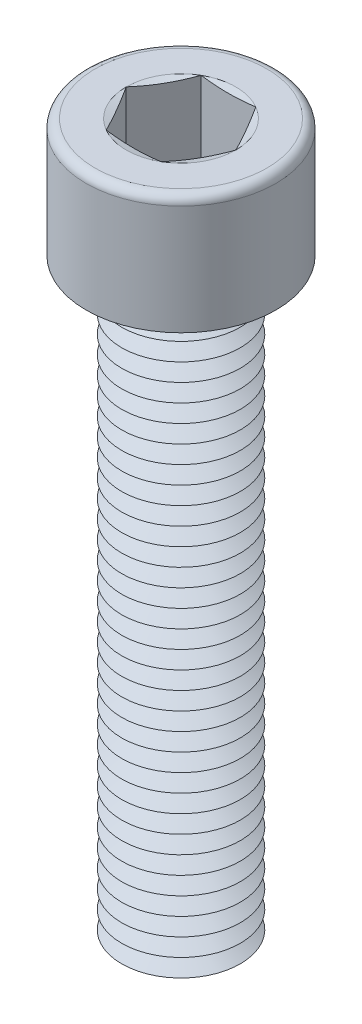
ISO-10303-21;
HEADER;
FILE_DESCRIPTION(('STEP AP214'),'2;1');
FILE_NAME('part.step','',(''),(''),'','','');
FILE_SCHEMA(('AUTOMOTIVE_DESIGN { 1 0 10303 214 1 1 1 1 }'));
ENDSEC;
DATA;
#1=APPLICATION_CONTEXT('core data for automotive mechanical design processes');
#2=APPLICATION_PROTOCOL_DEFINITION('international standard','automotive_design',2000,#1);
#3=PRODUCT_CONTEXT('',#1,'mechanical');
#4=PRODUCT('Part','Part','',(#3));
#5=PRODUCT_RELATED_PRODUCT_CATEGORY('part','',(#4));
#6=PRODUCT_DEFINITION_FORMATION('','',#4);
#7=PRODUCT_DEFINITION_CONTEXT('part definition',#1,'design');
#8=PRODUCT_DEFINITION('design','',#6,#7);
#9=PRODUCT_DEFINITION_SHAPE('','',#8);
#10=(LENGTH_UNIT() NAMED_UNIT(*) SI_UNIT(.MILLI.,.METRE.));
#11=(NAMED_UNIT(*) PLANE_ANGLE_UNIT() SI_UNIT($,.RADIAN.));
#12=(NAMED_UNIT(*) SI_UNIT($,.STERADIAN.) SOLID_ANGLE_UNIT());
#13=UNCERTAINTY_MEASURE_WITH_UNIT(LENGTH_MEASURE(1.E-05),#10,'distance_accuracy_value','');
#14=(GEOMETRIC_REPRESENTATION_CONTEXT(3) GLOBAL_UNCERTAINTY_ASSIGNED_CONTEXT((#13)) GLOBAL_UNIT_ASSIGNED_CONTEXT((#10,
#11,#12)) REPRESENTATION_CONTEXT('',''));
#15=CARTESIAN_POINT('',(0.,0.,0.));
#16=DIRECTION('',(0.,0.,1.));
#17=DIRECTION('',(1.,0.,0.));
#18=AXIS2_PLACEMENT_3D('',#15,#16,#17);
#19=CARTESIAN_POINT('',(0.,6.,0.));
#20=DIRECTION('',(0.,1.,0.));
#21=DIRECTION('',(0.,0.,1.));
#22=AXIS2_PLACEMENT_3D('',#19,#20,#21);
#23=CONICAL_SURFACE('',#22,3.70096189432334,1.0471975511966);
#24=CARTESIAN_POINT('',(0.,6.75,0.));
#25=DIRECTION('',(0.,1.,0.));
#26=DIRECTION('',(0.,0.,1.));
#27=AXIS2_PLACEMENT_3D('',#24,#25,#26);
#28=CIRCLE('',#27,5.);
#29=CARTESIAN_POINT('',(0.,6.75,5.));
#30=VERTEX_POINT('',#29);
#31=EDGE_CURVE('E574',#30,#30,#28,.T.);
#32=ORIENTED_EDGE('',*,*,#31,.F.);
#33=EDGE_LOOP('',(#32));
#34=FACE_BOUND('',#33,.T.);
#35=CARTESIAN_POINT('',(0.,6.,0.));
#36=DIRECTION('',(0.,1.,0.));
#37=DIRECTION('',(0.,0.,1.));
#38=AXIS2_PLACEMENT_3D('',#35,#36,#37);
#39=CIRCLE('',#38,3.70096189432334);
#40=CARTESIAN_POINT('',(0.,6.,3.70096189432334));
#41=VERTEX_POINT('',#40);
#42=EDGE_CURVE('E577',#41,#41,#39,.T.);
#43=ORIENTED_EDGE('',*,*,#42,.T.);
#44=EDGE_LOOP('',(#43));
#45=FACE_BOUND('',#44,.T.);
#46=ADVANCED_FACE('F41',(#34,#45),#23,.T.);
#47=CARTESIAN_POINT('',(0.,5.25,0.));
#48=DIRECTION('',(0.,-1.,0.));
#49=DIRECTION('',(0.,0.,-1.));
#50=AXIS2_PLACEMENT_3D('',#47,#48,#49);
#51=CONICAL_SURFACE('',#50,5.,1.0471975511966);
#52=ORIENTED_EDGE('',*,*,#42,.F.);
#53=EDGE_LOOP('',(#52));
#54=FACE_BOUND('',#53,.T.);
#55=CARTESIAN_POINT('',(0.,5.25,0.));
#56=DIRECTION('',(0.,1.,0.));
#57=DIRECTION('',(0.,0.,1.));
#58=AXIS2_PLACEMENT_3D('',#55,#56,#57);
#59=CIRCLE('',#58,5.);
#60=CARTESIAN_POINT('',(0.,5.25,5.));
#61=VERTEX_POINT('',#60);
#62=EDGE_CURVE('E581',#61,#61,#59,.T.);
#63=ORIENTED_EDGE('',*,*,#62,.T.);
#64=EDGE_LOOP('',(#63));
#65=FACE_BOUND('',#64,.T.);
#66=ADVANCED_FACE('F251',(#54,#65),#51,.T.);
#67=CARTESIAN_POINT('',(0.,0.,0.));
#68=DIRECTION('',(0.,1.,0.));
#69=DIRECTION('',(0.,0.,1.));
#70=AXIS2_PLACEMENT_3D('',#67,#68,#69);
#71=PLANE('',#70);
#72=CARTESIAN_POINT('',(0.,0.,0.));
#73=DIRECTION('',(0.,1.,0.));
#74=DIRECTION('',(0.,0.,1.));
#75=AXIS2_PLACEMENT_3D('',#72,#73,#74);
#76=CIRCLE('',#75,3.70096189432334);
#77=CARTESIAN_POINT('',(0.,0.,3.70096189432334));
#78=VERTEX_POINT('',#77);
#79=EDGE_CURVE('E609',#78,#78,#76,.T.);
#80=ORIENTED_EDGE('',*,*,#79,.F.);
#81=EDGE_LOOP('',(#80));
#82=FACE_BOUND('',#81,.T.);
#83=ADVANCED_FACE('F248',(#82),#71,.F.);
#84=CARTESIAN_POINT('',(0.,0.,0.));
#85=DIRECTION('',(0.,1.,0.));
#86=DIRECTION('',(0.,0.,1.));
#87=AXIS2_PLACEMENT_3D('',#84,#85,#86);
#88=CONICAL_SURFACE('',#87,3.70096189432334,1.0471975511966);
#89=CARTESIAN_POINT('',(0.,0.749999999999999,0.));
#90=DIRECTION('',(0.,1.,0.));
#91=DIRECTION('',(0.,0.,1.));
#92=AXIS2_PLACEMENT_3D('',#89,#90,#91);
#93=CIRCLE('',#92,5.);
#94=CARTESIAN_POINT('',(0.,0.749999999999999,5.));
#95=VERTEX_POINT('',#94);
#96=EDGE_CURVE('E605',#95,#95,#93,.T.);
#97=ORIENTED_EDGE('',*,*,#96,.F.);
#98=EDGE_LOOP('',(#97));
#99=FACE_BOUND('',#98,.T.);
#100=ORIENTED_EDGE('',*,*,#79,.T.);
#101=EDGE_LOOP('',(#100));
#102=FACE_BOUND('',#101,.T.);
#103=ADVANCED_FACE('F250',(#99,#102),#88,.T.);
#104=CARTESIAN_POINT('',(0.,0.749999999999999,0.));
#105=DIRECTION('',(0.,-1.,0.));
#106=DIRECTION('',(0.,0.,-1.));
#107=AXIS2_PLACEMENT_3D('',#104,#105,#106);
#108=CONICAL_SURFACE('',#107,5.,1.0471975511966);
#109=CARTESIAN_POINT('',(0.,1.5,0.));
#110=DIRECTION('',(0.,1.,0.));
#111=DIRECTION('',(0.,0.,1.));
#112=AXIS2_PLACEMENT_3D('',#109,#110,#111);
#113=CIRCLE('',#112,3.70096189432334);
#114=CARTESIAN_POINT('',(0.,1.5,3.70096189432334));
#115=VERTEX_POINT('',#114);
#116=EDGE_CURVE('E601',#115,#115,#113,.T.);
#117=ORIENTED_EDGE('',*,*,#116,.F.);
#118=EDGE_LOOP('',(#117));
#119=FACE_BOUND('',#118,.T.);
#120=ORIENTED_EDGE('',*,*,#96,.T.);
#121=EDGE_LOOP('',(#120));
#122=FACE_BOUND('',#121,.T.);
#123=ADVANCED_FACE('F291',(#119,#122),#108,.T.);
#124=CARTESIAN_POINT('',(0.,1.5,0.));
#125=DIRECTION('',(0.,1.,0.));
#126=DIRECTION('',(0.,0.,1.));
#127=AXIS2_PLACEMENT_3D('',#124,#125,#126);
#128=CONICAL_SURFACE('',#127,3.70096189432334,1.0471975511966);
#129=CARTESIAN_POINT('',(0.,2.25,0.));
#130=DIRECTION('',(0.,1.,0.));
#131=DIRECTION('',(0.,0.,1.));
#132=AXIS2_PLACEMENT_3D('',#129,#130,#131);
#133=CIRCLE('',#132,5.);
#134=CARTESIAN_POINT('',(0.,2.25,5.));
#135=VERTEX_POINT('',#134);
#136=EDGE_CURVE('E597',#135,#135,#133,.T.);
#137=ORIENTED_EDGE('',*,*,#136,.F.);
#138=EDGE_LOOP('',(#137));
#139=FACE_BOUND('',#138,.T.);
#140=ORIENTED_EDGE('',*,*,#116,.T.);
#141=EDGE_LOOP('',(#140));
#142=FACE_BOUND('',#141,.T.);
#143=ADVANCED_FACE('F286',(#139,#142),#128,.T.);
#144=CARTESIAN_POINT('',(0.,2.25,0.));
#145=DIRECTION('',(0.,-1.,0.));
#146=DIRECTION('',(0.,0.,-1.));
#147=AXIS2_PLACEMENT_3D('',#144,#145,#146);
#148=CONICAL_SURFACE('',#147,5.,1.0471975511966);
#149=CARTESIAN_POINT('',(0.,3.,0.));
#150=DIRECTION('',(0.,1.,0.));
#151=DIRECTION('',(0.,0.,1.));
#152=AXIS2_PLACEMENT_3D('',#149,#150,#151);
#153=CIRCLE('',#152,3.70096189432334);
#154=CARTESIAN_POINT('',(0.,3.,3.70096189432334));
#155=VERTEX_POINT('',#154);
#156=EDGE_CURVE('E593',#155,#155,#153,.T.);
#157=ORIENTED_EDGE('',*,*,#156,.F.);
#158=EDGE_LOOP('',(#157));
#159=FACE_BOUND('',#158,.T.);
#160=ORIENTED_EDGE('',*,*,#136,.T.);
#161=EDGE_LOOP('',(#160));
#162=FACE_BOUND('',#161,.T.);
#163=ADVANCED_FACE('F283',(#159,#162),#148,.T.);
#164=CARTESIAN_POINT('',(0.,3.,0.));
#165=DIRECTION('',(0.,1.,0.));
#166=DIRECTION('',(0.,0.,1.));
#167=AXIS2_PLACEMENT_3D('',#164,#165,#166);
#168=CONICAL_SURFACE('',#167,3.70096189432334,1.0471975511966);
#169=CARTESIAN_POINT('',(0.,3.75,0.));
#170=DIRECTION('',(0.,1.,0.));
#171=DIRECTION('',(0.,0.,1.));
#172=AXIS2_PLACEMENT_3D('',#169,#170,#171);
#173=CIRCLE('',#172,5.);
#174=CARTESIAN_POINT('',(0.,3.75,5.));
#175=VERTEX_POINT('',#174);
#176=EDGE_CURVE('E589',#175,#175,#173,.T.);
#177=ORIENTED_EDGE('',*,*,#176,.F.);
#178=EDGE_LOOP('',(#177));
#179=FACE_BOUND('',#178,.T.);
#180=ORIENTED_EDGE('',*,*,#156,.T.);
#181=EDGE_LOOP('',(#180));
#182=FACE_BOUND('',#181,.T.);
#183=ADVANCED_FACE('F277',(#179,#182),#168,.T.);
#184=CARTESIAN_POINT('',(0.,3.75,0.));
#185=DIRECTION('',(0.,-1.,0.));
#186=DIRECTION('',(0.,0.,-1.));
#187=AXIS2_PLACEMENT_3D('',#184,#185,#186);
#188=CONICAL_SURFACE('',#187,5.,1.0471975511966);
#189=CARTESIAN_POINT('',(0.,4.5,0.));
#190=DIRECTION('',(0.,1.,0.));
#191=DIRECTION('',(0.,0.,1.));
#192=AXIS2_PLACEMENT_3D('',#189,#190,#191);
#193=CIRCLE('',#192,3.70096189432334);
#194=CARTESIAN_POINT('',(0.,4.5,3.70096189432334));
#195=VERTEX_POINT('',#194);
#196=EDGE_CURVE('E585',#195,#195,#193,.T.);
#197=ORIENTED_EDGE('',*,*,#196,.F.);
#198=EDGE_LOOP('',(#197));
#199=FACE_BOUND('',#198,.T.);
#200=ORIENTED_EDGE('',*,*,#176,.T.);
#201=EDGE_LOOP('',(#200));
#202=FACE_BOUND('',#201,.T.);
#203=ADVANCED_FACE('F273',(#199,#202),#188,.T.);
#204=CARTESIAN_POINT('',(0.,4.5,0.));
#205=DIRECTION('',(0.,1.,0.));
#206=DIRECTION('',(0.,0.,1.));
#207=AXIS2_PLACEMENT_3D('',#204,#205,#206);
#208=CONICAL_SURFACE('',#207,3.70096189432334,1.0471975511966);
#209=ORIENTED_EDGE('',*,*,#62,.F.);
#210=EDGE_LOOP('',(#209));
#211=FACE_BOUND('',#210,.T.);
#212=ORIENTED_EDGE('',*,*,#196,.T.);
#213=EDGE_LOOP('',(#212));
#214=FACE_BOUND('',#213,.T.);
#215=ADVANCED_FACE('F276',(#211,#214),#208,.T.);
#216=CARTESIAN_POINT('',(0.,7.5,0.));
#217=DIRECTION('',(0.,1.,0.));
#218=DIRECTION('',(0.,0.,1.));
#219=AXIS2_PLACEMENT_3D('',#216,#217,#218);
#220=CONICAL_SURFACE('',#219,3.70096189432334,1.0471975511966);
#221=CARTESIAN_POINT('',(0.,8.25,0.));
#222=DIRECTION('',(0.,1.,0.));
#223=DIRECTION('',(0.,0.,1.));
#224=AXIS2_PLACEMENT_3D('',#221,#222,#223);
#225=CIRCLE('',#224,5.);
#226=CARTESIAN_POINT('',(0.,8.25,5.));
#227=VERTEX_POINT('',#226);
#228=EDGE_CURVE('E566',#227,#227,#225,.T.);
#229=ORIENTED_EDGE('',*,*,#228,.F.);
#230=EDGE_LOOP('',(#229));
#231=FACE_BOUND('',#230,.T.);
#232=CARTESIAN_POINT('',(0.,7.5,0.));
#233=DIRECTION('',(0.,1.,0.));
#234=DIRECTION('',(0.,0.,1.));
#235=AXIS2_PLACEMENT_3D('',#232,#233,#234);
#236=CIRCLE('',#235,3.70096189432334);
#237=CARTESIAN_POINT('',(0.,7.5,3.70096189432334));
#238=VERTEX_POINT('',#237);
#239=EDGE_CURVE('E570',#238,#238,#236,.T.);
#240=ORIENTED_EDGE('',*,*,#239,.T.);
#241=EDGE_LOOP('',(#240));
#242=FACE_BOUND('',#241,.T.);
#243=ADVANCED_FACE('F281',(#231,#242),#220,.T.);
#244=CARTESIAN_POINT('',(0.,6.75,0.));
#245=DIRECTION('',(0.,-1.,0.));
#246=DIRECTION('',(0.,0.,-1.));
#247=AXIS2_PLACEMENT_3D('',#244,#245,#246);
#248=CONICAL_SURFACE('',#247,5.,1.0471975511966);
#249=ORIENTED_EDGE('',*,*,#239,.F.);
#250=EDGE_LOOP('',(#249));
#251=FACE_BOUND('',#250,.T.);
#252=ORIENTED_EDGE('',*,*,#31,.T.);
#253=EDGE_LOOP('',(#252));
#254=FACE_BOUND('',#253,.T.);
#255=ADVANCED_FACE('F842',(#251,#254),#248,.T.);
#256=CARTESIAN_POINT('',(0.,9.,0.));
#257=DIRECTION('',(0.,1.,0.));
#258=DIRECTION('',(0.,0.,1.));
#259=AXIS2_PLACEMENT_3D('',#256,#257,#258);
#260=CONICAL_SURFACE('',#259,3.70096189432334,1.0471975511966);
#261=CARTESIAN_POINT('',(0.,9.75,0.));
#262=DIRECTION('',(0.,1.,0.));
#263=DIRECTION('',(0.,0.,1.));
#264=AXIS2_PLACEMENT_3D('',#261,#262,#263);
#265=CIRCLE('',#264,5.);
#266=CARTESIAN_POINT('',(0.,9.75,5.));
#267=VERTEX_POINT('',#266);
#268=EDGE_CURVE('E558',#267,#267,#265,.T.);
#269=ORIENTED_EDGE('',*,*,#268,.F.);
#270=EDGE_LOOP('',(#269));
#271=FACE_BOUND('',#270,.T.);
#272=CARTESIAN_POINT('',(0.,9.,0.));
#273=DIRECTION('',(0.,1.,0.));
#274=DIRECTION('',(0.,0.,1.));
#275=AXIS2_PLACEMENT_3D('',#272,#273,#274);
#276=CIRCLE('',#275,3.70096189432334);
#277=CARTESIAN_POINT('',(0.,9.,3.70096189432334));
#278=VERTEX_POINT('',#277);
#279=EDGE_CURVE('E562',#278,#278,#276,.T.);
#280=ORIENTED_EDGE('',*,*,#279,.T.);
#281=EDGE_LOOP('',(#280));
#282=FACE_BOUND('',#281,.T.);
#283=ADVANCED_FACE('F851',(#271,#282),#260,.T.);
#284=CARTESIAN_POINT('',(0.,8.25,0.));
#285=DIRECTION('',(0.,-1.,0.));
#286=DIRECTION('',(0.,0.,-1.));
#287=AXIS2_PLACEMENT_3D('',#284,#285,#286);
#288=CONICAL_SURFACE('',#287,5.,1.0471975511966);
#289=ORIENTED_EDGE('',*,*,#279,.F.);
#290=EDGE_LOOP('',(#289));
#291=FACE_BOUND('',#290,.T.);
#292=ORIENTED_EDGE('',*,*,#228,.T.);
#293=EDGE_LOOP('',(#292));
#294=FACE_BOUND('',#293,.T.);
#295=ADVANCED_FACE('F861',(#291,#294),#288,.T.);
#296=CARTESIAN_POINT('',(0.,10.5,0.));
#297=DIRECTION('',(0.,1.,0.));
#298=DIRECTION('',(0.,0.,1.));
#299=AXIS2_PLACEMENT_3D('',#296,#297,#298);
#300=CONICAL_SURFACE('',#299,3.70096189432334,1.0471975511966);
#301=CARTESIAN_POINT('',(0.,11.25,0.));
#302=DIRECTION('',(0.,1.,0.));
#303=DIRECTION('',(0.,0.,1.));
#304=AXIS2_PLACEMENT_3D('',#301,#302,#303);
#305=CIRCLE('',#304,5.);
#306=CARTESIAN_POINT('',(0.,11.25,5.));
#307=VERTEX_POINT('',#306);
#308=EDGE_CURVE('E550',#307,#307,#305,.T.);
#309=ORIENTED_EDGE('',*,*,#308,.F.);
#310=EDGE_LOOP('',(#309));
#311=FACE_BOUND('',#310,.T.);
#312=CARTESIAN_POINT('',(0.,10.5,0.));
#313=DIRECTION('',(0.,1.,0.));
#314=DIRECTION('',(0.,0.,1.));
#315=AXIS2_PLACEMENT_3D('',#312,#313,#314);
#316=CIRCLE('',#315,3.70096189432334);
#317=CARTESIAN_POINT('',(0.,10.5,3.70096189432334));
#318=VERTEX_POINT('',#317);
#319=EDGE_CURVE('E554',#318,#318,#316,.T.);
#320=ORIENTED_EDGE('',*,*,#319,.T.);
#321=EDGE_LOOP('',(#320));
#322=FACE_BOUND('',#321,.T.);
#323=ADVANCED_FACE('F871',(#311,#322),#300,.T.);
#324=CARTESIAN_POINT('',(0.,9.75,0.));
#325=DIRECTION('',(0.,-1.,0.));
#326=DIRECTION('',(0.,0.,-1.));
#327=AXIS2_PLACEMENT_3D('',#324,#325,#326);
#328=CONICAL_SURFACE('',#327,5.,1.0471975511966);
#329=ORIENTED_EDGE('',*,*,#319,.F.);
#330=EDGE_LOOP('',(#329));
#331=FACE_BOUND('',#330,.T.);
#332=ORIENTED_EDGE('',*,*,#268,.T.);
#333=EDGE_LOOP('',(#332));
#334=FACE_BOUND('',#333,.T.);
#335=ADVANCED_FACE('F881',(#331,#334),#328,.T.);
#336=CARTESIAN_POINT('',(0.,12.,0.));
#337=DIRECTION('',(0.,1.,0.));
#338=DIRECTION('',(0.,0.,1.));
#339=AXIS2_PLACEMENT_3D('',#336,#337,#338);
#340=CONICAL_SURFACE('',#339,3.70096189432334,1.0471975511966);
#341=CARTESIAN_POINT('',(0.,12.75,0.));
#342=DIRECTION('',(0.,1.,0.));
#343=DIRECTION('',(0.,0.,1.));
#344=AXIS2_PLACEMENT_3D('',#341,#342,#343);
#345=CIRCLE('',#344,5.);
#346=CARTESIAN_POINT('',(0.,12.75,5.));
#347=VERTEX_POINT('',#346);
#348=EDGE_CURVE('E542',#347,#347,#345,.T.);
#349=ORIENTED_EDGE('',*,*,#348,.F.);
#350=EDGE_LOOP('',(#349));
#351=FACE_BOUND('',#350,.T.);
#352=CARTESIAN_POINT('',(0.,12.,0.));
#353=DIRECTION('',(0.,1.,0.));
#354=DIRECTION('',(0.,0.,1.));
#355=AXIS2_PLACEMENT_3D('',#352,#353,#354);
#356=CIRCLE('',#355,3.70096189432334);
#357=CARTESIAN_POINT('',(0.,12.,3.70096189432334));
#358=VERTEX_POINT('',#357);
#359=EDGE_CURVE('E546',#358,#358,#356,.T.);
#360=ORIENTED_EDGE('',*,*,#359,.T.);
#361=EDGE_LOOP('',(#360));
#362=FACE_BOUND('',#361,.T.);
#363=ADVANCED_FACE('F891',(#351,#362),#340,.T.);
#364=CARTESIAN_POINT('',(0.,11.25,0.));
#365=DIRECTION('',(0.,-1.,0.));
#366=DIRECTION('',(0.,0.,-1.));
#367=AXIS2_PLACEMENT_3D('',#364,#365,#366);
#368=CONICAL_SURFACE('',#367,5.,1.0471975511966);
#369=ORIENTED_EDGE('',*,*,#359,.F.);
#370=EDGE_LOOP('',(#369));
#371=FACE_BOUND('',#370,.T.);
#372=ORIENTED_EDGE('',*,*,#308,.T.);
#373=EDGE_LOOP('',(#372));
#374=FACE_BOUND('',#373,.T.);
#375=ADVANCED_FACE('F901',(#371,#374),#368,.T.);
#376=CARTESIAN_POINT('',(0.,13.5,0.));
#377=DIRECTION('',(0.,1.,0.));
#378=DIRECTION('',(0.,0.,1.));
#379=AXIS2_PLACEMENT_3D('',#376,#377,#378);
#380=CONICAL_SURFACE('',#379,3.70096189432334,1.0471975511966);
#381=CARTESIAN_POINT('',(0.,14.25,0.));
#382=DIRECTION('',(0.,1.,0.));
#383=DIRECTION('',(0.,0.,1.));
#384=AXIS2_PLACEMENT_3D('',#381,#382,#383);
#385=CIRCLE('',#384,5.);
#386=CARTESIAN_POINT('',(0.,14.25,5.));
#387=VERTEX_POINT('',#386);
#388=EDGE_CURVE('E534',#387,#387,#385,.T.);
#389=ORIENTED_EDGE('',*,*,#388,.F.);
#390=EDGE_LOOP('',(#389));
#391=FACE_BOUND('',#390,.T.);
#392=CARTESIAN_POINT('',(0.,13.5,0.));
#393=DIRECTION('',(0.,1.,0.));
#394=DIRECTION('',(0.,0.,1.));
#395=AXIS2_PLACEMENT_3D('',#392,#393,#394);
#396=CIRCLE('',#395,3.70096189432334);
#397=CARTESIAN_POINT('',(0.,13.5,3.70096189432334));
#398=VERTEX_POINT('',#397);
#399=EDGE_CURVE('E538',#398,#398,#396,.T.);
#400=ORIENTED_EDGE('',*,*,#399,.T.);
#401=EDGE_LOOP('',(#400));
#402=FACE_BOUND('',#401,.T.);
#403=ADVANCED_FACE('F911',(#391,#402),#380,.T.);
#404=CARTESIAN_POINT('',(0.,12.75,0.));
#405=DIRECTION('',(0.,-1.,0.));
#406=DIRECTION('',(0.,0.,-1.));
#407=AXIS2_PLACEMENT_3D('',#404,#405,#406);
#408=CONICAL_SURFACE('',#407,5.,1.0471975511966);
#409=ORIENTED_EDGE('',*,*,#399,.F.);
#410=EDGE_LOOP('',(#409));
#411=FACE_BOUND('',#410,.T.);
#412=ORIENTED_EDGE('',*,*,#348,.T.);
#413=EDGE_LOOP('',(#412));
#414=FACE_BOUND('',#413,.T.);
#415=ADVANCED_FACE('F921',(#411,#414),#408,.T.);
#416=CARTESIAN_POINT('',(0.,15.,0.));
#417=DIRECTION('',(0.,1.,0.));
#418=DIRECTION('',(0.,0.,1.));
#419=AXIS2_PLACEMENT_3D('',#416,#417,#418);
#420=CONICAL_SURFACE('',#419,3.70096189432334,1.0471975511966);
#421=CARTESIAN_POINT('',(0.,15.75,0.));
#422=DIRECTION('',(0.,1.,0.));
#423=DIRECTION('',(0.,0.,1.));
#424=AXIS2_PLACEMENT_3D('',#421,#422,#423);
#425=CIRCLE('',#424,5.);
#426=CARTESIAN_POINT('',(0.,15.75,5.));
#427=VERTEX_POINT('',#426);
#428=EDGE_CURVE('E526',#427,#427,#425,.T.);
#429=ORIENTED_EDGE('',*,*,#428,.F.);
#430=EDGE_LOOP('',(#429));
#431=FACE_BOUND('',#430,.T.);
#432=CARTESIAN_POINT('',(0.,15.,0.));
#433=DIRECTION('',(0.,1.,0.));
#434=DIRECTION('',(0.,0.,1.));
#435=AXIS2_PLACEMENT_3D('',#432,#433,#434);
#436=CIRCLE('',#435,3.70096189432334);
#437=CARTESIAN_POINT('',(0.,15.,3.70096189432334));
#438=VERTEX_POINT('',#437);
#439=EDGE_CURVE('E530',#438,#438,#436,.T.);
#440=ORIENTED_EDGE('',*,*,#439,.T.);
#441=EDGE_LOOP('',(#440));
#442=FACE_BOUND('',#441,.T.);
#443=ADVANCED_FACE('F931',(#431,#442),#420,.T.);
#444=CARTESIAN_POINT('',(0.,14.25,0.));
#445=DIRECTION('',(0.,-1.,0.));
#446=DIRECTION('',(0.,0.,-1.));
#447=AXIS2_PLACEMENT_3D('',#444,#445,#446);
#448=CONICAL_SURFACE('',#447,5.,1.0471975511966);
#449=ORIENTED_EDGE('',*,*,#439,.F.);
#450=EDGE_LOOP('',(#449));
#451=FACE_BOUND('',#450,.T.);
#452=ORIENTED_EDGE('',*,*,#388,.T.);
#453=EDGE_LOOP('',(#452));
#454=FACE_BOUND('',#453,.T.);
#455=ADVANCED_FACE('F941',(#451,#454),#448,.T.);
#456=CARTESIAN_POINT('',(0.,16.5,0.));
#457=DIRECTION('',(0.,1.,0.));
#458=DIRECTION('',(0.,0.,1.));
#459=AXIS2_PLACEMENT_3D('',#456,#457,#458);
#460=CONICAL_SURFACE('',#459,3.70096189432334,1.0471975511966);
#461=CARTESIAN_POINT('',(0.,17.25,0.));
#462=DIRECTION('',(0.,1.,0.));
#463=DIRECTION('',(0.,0.,1.));
#464=AXIS2_PLACEMENT_3D('',#461,#462,#463);
#465=CIRCLE('',#464,5.);
#466=CARTESIAN_POINT('',(0.,17.25,5.));
#467=VERTEX_POINT('',#466);
#468=EDGE_CURVE('E518',#467,#467,#465,.T.);
#469=ORIENTED_EDGE('',*,*,#468,.F.);
#470=EDGE_LOOP('',(#469));
#471=FACE_BOUND('',#470,.T.);
#472=CARTESIAN_POINT('',(0.,16.5,0.));
#473=DIRECTION('',(0.,1.,0.));
#474=DIRECTION('',(0.,0.,1.));
#475=AXIS2_PLACEMENT_3D('',#472,#473,#474);
#476=CIRCLE('',#475,3.70096189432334);
#477=CARTESIAN_POINT('',(0.,16.5,3.70096189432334));
#478=VERTEX_POINT('',#477);
#479=EDGE_CURVE('E522',#478,#478,#476,.T.);
#480=ORIENTED_EDGE('',*,*,#479,.T.);
#481=EDGE_LOOP('',(#480));
#482=FACE_BOUND('',#481,.T.);
#483=ADVANCED_FACE('F951',(#471,#482),#460,.T.);
#484=CARTESIAN_POINT('',(0.,15.75,0.));
#485=DIRECTION('',(0.,-1.,0.));
#486=DIRECTION('',(0.,0.,-1.));
#487=AXIS2_PLACEMENT_3D('',#484,#485,#486);
#488=CONICAL_SURFACE('',#487,5.,1.0471975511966);
#489=ORIENTED_EDGE('',*,*,#479,.F.);
#490=EDGE_LOOP('',(#489));
#491=FACE_BOUND('',#490,.T.);
#492=ORIENTED_EDGE('',*,*,#428,.T.);
#493=EDGE_LOOP('',(#492));
#494=FACE_BOUND('',#493,.T.);
#495=ADVANCED_FACE('F961',(#491,#494),#488,.T.);
#496=CARTESIAN_POINT('',(0.,18.,0.));
#497=DIRECTION('',(0.,1.,0.));
#498=DIRECTION('',(0.,0.,1.));
#499=AXIS2_PLACEMENT_3D('',#496,#497,#498);
#500=CONICAL_SURFACE('',#499,3.70096189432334,1.0471975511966);
#501=CARTESIAN_POINT('',(0.,18.75,0.));
#502=DIRECTION('',(0.,1.,0.));
#503=DIRECTION('',(0.,0.,1.));
#504=AXIS2_PLACEMENT_3D('',#501,#502,#503);
#505=CIRCLE('',#504,5.);
#506=CARTESIAN_POINT('',(0.,18.75,5.));
#507=VERTEX_POINT('',#506);
#508=EDGE_CURVE('E510',#507,#507,#505,.T.);
#509=ORIENTED_EDGE('',*,*,#508,.F.);
#510=EDGE_LOOP('',(#509));
#511=FACE_BOUND('',#510,.T.);
#512=CARTESIAN_POINT('',(0.,18.,0.));
#513=DIRECTION('',(0.,1.,0.));
#514=DIRECTION('',(0.,0.,1.));
#515=AXIS2_PLACEMENT_3D('',#512,#513,#514);
#516=CIRCLE('',#515,3.70096189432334);
#517=CARTESIAN_POINT('',(0.,18.,3.70096189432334));
#518=VERTEX_POINT('',#517);
#519=EDGE_CURVE('E514',#518,#518,#516,.T.);
#520=ORIENTED_EDGE('',*,*,#519,.T.);
#521=EDGE_LOOP('',(#520));
#522=FACE_BOUND('',#521,.T.);
#523=ADVANCED_FACE('F971',(#511,#522),#500,.T.);
#524=CARTESIAN_POINT('',(0.,17.25,0.));
#525=DIRECTION('',(0.,-1.,0.));
#526=DIRECTION('',(0.,0.,-1.));
#527=AXIS2_PLACEMENT_3D('',#524,#525,#526);
#528=CONICAL_SURFACE('',#527,5.,1.0471975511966);
#529=ORIENTED_EDGE('',*,*,#519,.F.);
#530=EDGE_LOOP('',(#529));
#531=FACE_BOUND('',#530,.T.);
#532=ORIENTED_EDGE('',*,*,#468,.T.);
#533=EDGE_LOOP('',(#532));
#534=FACE_BOUND('',#533,.T.);
#535=ADVANCED_FACE('F981',(#531,#534),#528,.T.);
#536=CARTESIAN_POINT('',(0.,19.5,0.));
#537=DIRECTION('',(0.,1.,0.));
#538=DIRECTION('',(0.,0.,1.));
#539=AXIS2_PLACEMENT_3D('',#536,#537,#538);
#540=CONICAL_SURFACE('',#539,3.70096189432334,1.0471975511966);
#541=CARTESIAN_POINT('',(0.,20.25,0.));
#542=DIRECTION('',(0.,1.,0.));
#543=DIRECTION('',(0.,0.,1.));
#544=AXIS2_PLACEMENT_3D('',#541,#542,#543);
#545=CIRCLE('',#544,5.);
#546=CARTESIAN_POINT('',(0.,20.25,5.));
#547=VERTEX_POINT('',#546);
#548=EDGE_CURVE('E502',#547,#547,#545,.T.);
#549=ORIENTED_EDGE('',*,*,#548,.F.);
#550=EDGE_LOOP('',(#549));
#551=FACE_BOUND('',#550,.T.);
#552=CARTESIAN_POINT('',(0.,19.5,0.));
#553=DIRECTION('',(0.,1.,0.));
#554=DIRECTION('',(0.,0.,1.));
#555=AXIS2_PLACEMENT_3D('',#552,#553,#554);
#556=CIRCLE('',#555,3.70096189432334);
#557=CARTESIAN_POINT('',(0.,19.5,3.70096189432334));
#558=VERTEX_POINT('',#557);
#559=EDGE_CURVE('E506',#558,#558,#556,.T.);
#560=ORIENTED_EDGE('',*,*,#559,.T.);
#561=EDGE_LOOP('',(#560));
#562=FACE_BOUND('',#561,.T.);
#563=ADVANCED_FACE('F991',(#551,#562),#540,.T.);
#564=CARTESIAN_POINT('',(0.,18.75,0.));
#565=DIRECTION('',(0.,-1.,0.));
#566=DIRECTION('',(0.,0.,-1.));
#567=AXIS2_PLACEMENT_3D('',#564,#565,#566);
#568=CONICAL_SURFACE('',#567,5.,1.0471975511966);
#569=ORIENTED_EDGE('',*,*,#559,.F.);
#570=EDGE_LOOP('',(#569));
#571=FACE_BOUND('',#570,.T.);
#572=ORIENTED_EDGE('',*,*,#508,.T.);
#573=EDGE_LOOP('',(#572));
#574=FACE_BOUND('',#573,.T.);
#575=ADVANCED_FACE('F1001',(#571,#574),#568,.T.);
#576=CARTESIAN_POINT('',(0.,21.,0.));
#577=DIRECTION('',(0.,1.,0.));
#578=DIRECTION('',(0.,0.,1.));
#579=AXIS2_PLACEMENT_3D('',#576,#577,#578);
#580=CONICAL_SURFACE('',#579,3.70096189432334,1.0471975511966);
#581=CARTESIAN_POINT('',(0.,21.75,0.));
#582=DIRECTION('',(0.,1.,0.));
#583=DIRECTION('',(0.,0.,1.));
#584=AXIS2_PLACEMENT_3D('',#581,#582,#583);
#585=CIRCLE('',#584,5.);
#586=CARTESIAN_POINT('',(0.,21.75,5.));
#587=VERTEX_POINT('',#586);
#588=EDGE_CURVE('E494',#587,#587,#585,.T.);
#589=ORIENTED_EDGE('',*,*,#588,.F.);
#590=EDGE_LOOP('',(#589));
#591=FACE_BOUND('',#590,.T.);
#592=CARTESIAN_POINT('',(0.,21.,0.));
#593=DIRECTION('',(0.,1.,0.));
#594=DIRECTION('',(0.,0.,1.));
#595=AXIS2_PLACEMENT_3D('',#592,#593,#594);
#596=CIRCLE('',#595,3.70096189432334);
#597=CARTESIAN_POINT('',(0.,21.,3.70096189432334));
#598=VERTEX_POINT('',#597);
#599=EDGE_CURVE('E498',#598,#598,#596,.T.);
#600=ORIENTED_EDGE('',*,*,#599,.T.);
#601=EDGE_LOOP('',(#600));
#602=FACE_BOUND('',#601,.T.);
#603=ADVANCED_FACE('F1011',(#591,#602),#580,.T.);
#604=CARTESIAN_POINT('',(0.,20.25,0.));
#605=DIRECTION('',(0.,-1.,0.));
#606=DIRECTION('',(0.,0.,-1.));
#607=AXIS2_PLACEMENT_3D('',#604,#605,#606);
#608=CONICAL_SURFACE('',#607,5.,1.0471975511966);
#609=ORIENTED_EDGE('',*,*,#599,.F.);
#610=EDGE_LOOP('',(#609));
#611=FACE_BOUND('',#610,.T.);
#612=ORIENTED_EDGE('',*,*,#548,.T.);
#613=EDGE_LOOP('',(#612));
#614=FACE_BOUND('',#613,.T.);
#615=ADVANCED_FACE('F1021',(#611,#614),#608,.T.);
#616=CARTESIAN_POINT('',(0.,22.5,0.));
#617=DIRECTION('',(0.,1.,0.));
#618=DIRECTION('',(0.,0.,1.));
#619=AXIS2_PLACEMENT_3D('',#616,#617,#618);
#620=CONICAL_SURFACE('',#619,3.70096189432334,1.0471975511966);
#621=CARTESIAN_POINT('',(0.,23.25,0.));
#622=DIRECTION('',(0.,1.,0.));
#623=DIRECTION('',(0.,0.,1.));
#624=AXIS2_PLACEMENT_3D('',#621,#622,#623);
#625=CIRCLE('',#624,5.);
#626=CARTESIAN_POINT('',(0.,23.25,5.));
#627=VERTEX_POINT('',#626);
#628=EDGE_CURVE('E486',#627,#627,#625,.T.);
#629=ORIENTED_EDGE('',*,*,#628,.F.);
#630=EDGE_LOOP('',(#629));
#631=FACE_BOUND('',#630,.T.);
#632=CARTESIAN_POINT('',(0.,22.5,0.));
#633=DIRECTION('',(0.,1.,0.));
#634=DIRECTION('',(0.,0.,1.));
#635=AXIS2_PLACEMENT_3D('',#632,#633,#634);
#636=CIRCLE('',#635,3.70096189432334);
#637=CARTESIAN_POINT('',(0.,22.5,3.70096189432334));
#638=VERTEX_POINT('',#637);
#639=EDGE_CURVE('E490',#638,#638,#636,.T.);
#640=ORIENTED_EDGE('',*,*,#639,.T.);
#641=EDGE_LOOP('',(#640));
#642=FACE_BOUND('',#641,.T.);
#643=ADVANCED_FACE('F1031',(#631,#642),#620,.T.);
#644=CARTESIAN_POINT('',(0.,21.75,0.));
#645=DIRECTION('',(0.,-1.,0.));
#646=DIRECTION('',(0.,0.,-1.));
#647=AXIS2_PLACEMENT_3D('',#644,#645,#646);
#648=CONICAL_SURFACE('',#647,5.,1.0471975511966);
#649=ORIENTED_EDGE('',*,*,#639,.F.);
#650=EDGE_LOOP('',(#649));
#651=FACE_BOUND('',#650,.T.);
#652=ORIENTED_EDGE('',*,*,#588,.T.);
#653=EDGE_LOOP('',(#652));
#654=FACE_BOUND('',#653,.T.);
#655=ADVANCED_FACE('F1041',(#651,#654),#648,.T.);
#656=CARTESIAN_POINT('',(0.,24.,0.));
#657=DIRECTION('',(0.,1.,0.));
#658=DIRECTION('',(0.,0.,1.));
#659=AXIS2_PLACEMENT_3D('',#656,#657,#658);
#660=CONICAL_SURFACE('',#659,3.70096189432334,1.0471975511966);
#661=CARTESIAN_POINT('',(0.,24.75,0.));
#662=DIRECTION('',(0.,1.,0.));
#663=DIRECTION('',(0.,0.,1.));
#664=AXIS2_PLACEMENT_3D('',#661,#662,#663);
#665=CIRCLE('',#664,5.);
#666=CARTESIAN_POINT('',(0.,24.75,5.));
#667=VERTEX_POINT('',#666);
#668=EDGE_CURVE('E478',#667,#667,#665,.T.);
#669=ORIENTED_EDGE('',*,*,#668,.F.);
#670=EDGE_LOOP('',(#669));
#671=FACE_BOUND('',#670,.T.);
#672=CARTESIAN_POINT('',(0.,24.,0.));
#673=DIRECTION('',(0.,1.,0.));
#674=DIRECTION('',(0.,0.,1.));
#675=AXIS2_PLACEMENT_3D('',#672,#673,#674);
#676=CIRCLE('',#675,3.70096189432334);
#677=CARTESIAN_POINT('',(0.,24.,3.70096189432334));
#678=VERTEX_POINT('',#677);
#679=EDGE_CURVE('E482',#678,#678,#676,.T.);
#680=ORIENTED_EDGE('',*,*,#679,.T.);
#681=EDGE_LOOP('',(#680));
#682=FACE_BOUND('',#681,.T.);
#683=ADVANCED_FACE('F1051',(#671,#682),#660,.T.);
#684=CARTESIAN_POINT('',(0.,23.25,0.));
#685=DIRECTION('',(0.,-1.,0.));
#686=DIRECTION('',(0.,0.,-1.));
#687=AXIS2_PLACEMENT_3D('',#684,#685,#686);
#688=CONICAL_SURFACE('',#687,5.,1.0471975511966);
#689=ORIENTED_EDGE('',*,*,#679,.F.);
#690=EDGE_LOOP('',(#689));
#691=FACE_BOUND('',#690,.T.);
#692=ORIENTED_EDGE('',*,*,#628,.T.);
#693=EDGE_LOOP('',(#692));
#694=FACE_BOUND('',#693,.T.);
#695=ADVANCED_FACE('F1061',(#691,#694),#688,.T.);
#696=CARTESIAN_POINT('',(0.,25.5,0.));
#697=DIRECTION('',(0.,1.,0.));
#698=DIRECTION('',(0.,0.,1.));
#699=AXIS2_PLACEMENT_3D('',#696,#697,#698);
#700=CONICAL_SURFACE('',#699,3.70096189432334,1.0471975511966);
#701=CARTESIAN_POINT('',(0.,26.25,0.));
#702=DIRECTION('',(0.,1.,0.));
#703=DIRECTION('',(0.,0.,1.));
#704=AXIS2_PLACEMENT_3D('',#701,#702,#703);
#705=CIRCLE('',#704,5.);
#706=CARTESIAN_POINT('',(0.,26.25,5.));
#707=VERTEX_POINT('',#706);
#708=EDGE_CURVE('E470',#707,#707,#705,.T.);
#709=ORIENTED_EDGE('',*,*,#708,.F.);
#710=EDGE_LOOP('',(#709));
#711=FACE_BOUND('',#710,.T.);
#712=CARTESIAN_POINT('',(0.,25.5,0.));
#713=DIRECTION('',(0.,1.,0.));
#714=DIRECTION('',(0.,0.,1.));
#715=AXIS2_PLACEMENT_3D('',#712,#713,#714);
#716=CIRCLE('',#715,3.70096189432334);
#717=CARTESIAN_POINT('',(0.,25.5,3.70096189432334));
#718=VERTEX_POINT('',#717);
#719=EDGE_CURVE('E474',#718,#718,#716,.T.);
#720=ORIENTED_EDGE('',*,*,#719,.T.);
#721=EDGE_LOOP('',(#720));
#722=FACE_BOUND('',#721,.T.);
#723=ADVANCED_FACE('F1071',(#711,#722),#700,.T.);
#724=CARTESIAN_POINT('',(0.,24.75,0.));
#725=DIRECTION('',(0.,-1.,0.));
#726=DIRECTION('',(0.,0.,-1.));
#727=AXIS2_PLACEMENT_3D('',#724,#725,#726);
#728=CONICAL_SURFACE('',#727,5.,1.0471975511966);
#729=ORIENTED_EDGE('',*,*,#719,.F.);
#730=EDGE_LOOP('',(#729));
#731=FACE_BOUND('',#730,.T.);
#732=ORIENTED_EDGE('',*,*,#668,.T.);
#733=EDGE_LOOP('',(#732));
#734=FACE_BOUND('',#733,.T.);
#735=ADVANCED_FACE('F1081',(#731,#734),#728,.T.);
#736=CARTESIAN_POINT('',(0.,27.,0.));
#737=DIRECTION('',(0.,1.,0.));
#738=DIRECTION('',(0.,0.,1.));
#739=AXIS2_PLACEMENT_3D('',#736,#737,#738);
#740=CONICAL_SURFACE('',#739,3.70096189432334,1.0471975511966);
#741=CARTESIAN_POINT('',(0.,27.75,0.));
#742=DIRECTION('',(0.,1.,0.));
#743=DIRECTION('',(0.,0.,1.));
#744=AXIS2_PLACEMENT_3D('',#741,#742,#743);
#745=CIRCLE('',#744,5.);
#746=CARTESIAN_POINT('',(0.,27.75,5.));
#747=VERTEX_POINT('',#746);
#748=EDGE_CURVE('E462',#747,#747,#745,.T.);
#749=ORIENTED_EDGE('',*,*,#748,.F.);
#750=EDGE_LOOP('',(#749));
#751=FACE_BOUND('',#750,.T.);
#752=CARTESIAN_POINT('',(0.,27.,0.));
#753=DIRECTION('',(0.,1.,0.));
#754=DIRECTION('',(0.,0.,1.));
#755=AXIS2_PLACEMENT_3D('',#752,#753,#754);
#756=CIRCLE('',#755,3.70096189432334);
#757=CARTESIAN_POINT('',(0.,27.,3.70096189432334));
#758=VERTEX_POINT('',#757);
#759=EDGE_CURVE('E466',#758,#758,#756,.T.);
#760=ORIENTED_EDGE('',*,*,#759,.T.);
#761=EDGE_LOOP('',(#760));
#762=FACE_BOUND('',#761,.T.);
#763=ADVANCED_FACE('F1091',(#751,#762),#740,.T.);
#764=CARTESIAN_POINT('',(0.,26.25,0.));
#765=DIRECTION('',(0.,-1.,0.));
#766=DIRECTION('',(0.,0.,-1.));
#767=AXIS2_PLACEMENT_3D('',#764,#765,#766);
#768=CONICAL_SURFACE('',#767,5.,1.0471975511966);
#769=ORIENTED_EDGE('',*,*,#759,.F.);
#770=EDGE_LOOP('',(#769));
#771=FACE_BOUND('',#770,.T.);
#772=ORIENTED_EDGE('',*,*,#708,.T.);
#773=EDGE_LOOP('',(#772));
#774=FACE_BOUND('',#773,.T.);
#775=ADVANCED_FACE('F1101',(#771,#774),#768,.T.);
#776=CARTESIAN_POINT('',(0.,28.5,0.));
#777=DIRECTION('',(0.,1.,0.));
#778=DIRECTION('',(0.,0.,1.));
#779=AXIS2_PLACEMENT_3D('',#776,#777,#778);
#780=CONICAL_SURFACE('',#779,3.70096189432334,1.0471975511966);
#781=CARTESIAN_POINT('',(0.,29.25,0.));
#782=DIRECTION('',(0.,1.,0.));
#783=DIRECTION('',(0.,0.,1.));
#784=AXIS2_PLACEMENT_3D('',#781,#782,#783);
#785=CIRCLE('',#784,5.);
#786=CARTESIAN_POINT('',(0.,29.25,5.));
#787=VERTEX_POINT('',#786);
#788=EDGE_CURVE('E454',#787,#787,#785,.T.);
#789=ORIENTED_EDGE('',*,*,#788,.F.);
#790=EDGE_LOOP('',(#789));
#791=FACE_BOUND('',#790,.T.);
#792=CARTESIAN_POINT('',(0.,28.5,0.));
#793=DIRECTION('',(0.,1.,0.));
#794=DIRECTION('',(0.,0.,1.));
#795=AXIS2_PLACEMENT_3D('',#792,#793,#794);
#796=CIRCLE('',#795,3.70096189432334);
#797=CARTESIAN_POINT('',(0.,28.5,3.70096189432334));
#798=VERTEX_POINT('',#797);
#799=EDGE_CURVE('E458',#798,#798,#796,.T.);
#800=ORIENTED_EDGE('',*,*,#799,.T.);
#801=EDGE_LOOP('',(#800));
#802=FACE_BOUND('',#801,.T.);
#803=ADVANCED_FACE('F1111',(#791,#802),#780,.T.);
#804=CARTESIAN_POINT('',(0.,27.75,0.));
#805=DIRECTION('',(0.,-1.,0.));
#806=DIRECTION('',(0.,0.,-1.));
#807=AXIS2_PLACEMENT_3D('',#804,#805,#806);
#808=CONICAL_SURFACE('',#807,5.,1.0471975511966);
#809=ORIENTED_EDGE('',*,*,#799,.F.);
#810=EDGE_LOOP('',(#809));
#811=FACE_BOUND('',#810,.T.);
#812=ORIENTED_EDGE('',*,*,#748,.T.);
#813=EDGE_LOOP('',(#812));
#814=FACE_BOUND('',#813,.T.);
#815=ADVANCED_FACE('F1121',(#811,#814),#808,.T.);
#816=CARTESIAN_POINT('',(0.,30.,0.));
#817=DIRECTION('',(0.,1.,0.));
#818=DIRECTION('',(0.,0.,1.));
#819=AXIS2_PLACEMENT_3D('',#816,#817,#818);
#820=CONICAL_SURFACE('',#819,3.70096189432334,1.0471975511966);
#821=CARTESIAN_POINT('',(0.,30.75,0.));
#822=DIRECTION('',(0.,1.,0.));
#823=DIRECTION('',(0.,0.,1.));
#824=AXIS2_PLACEMENT_3D('',#821,#822,#823);
#825=CIRCLE('',#824,5.);
#826=CARTESIAN_POINT('',(0.,30.75,5.));
#827=VERTEX_POINT('',#826);
#828=EDGE_CURVE('E447',#827,#827,#825,.T.);
#829=ORIENTED_EDGE('',*,*,#828,.F.);
#830=EDGE_LOOP('',(#829));
#831=FACE_BOUND('',#830,.T.);
#832=CARTESIAN_POINT('',(0.,30.,0.));
#833=DIRECTION('',(0.,1.,0.));
#834=DIRECTION('',(0.,0.,1.));
#835=AXIS2_PLACEMENT_3D('',#832,#833,#834);
#836=CIRCLE('',#835,3.70096189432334);
#837=CARTESIAN_POINT('',(0.,30.,3.70096189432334));
#838=VERTEX_POINT('',#837);
#839=EDGE_CURVE('E451',#838,#838,#836,.T.);
#840=ORIENTED_EDGE('',*,*,#839,.T.);
#841=EDGE_LOOP('',(#840));
#842=FACE_BOUND('',#841,.T.);
#843=ADVANCED_FACE('F1131',(#831,#842),#820,.T.);
#844=CARTESIAN_POINT('',(0.,29.25,0.));
#845=DIRECTION('',(0.,-1.,0.));
#846=DIRECTION('',(0.,0.,-1.));
#847=AXIS2_PLACEMENT_3D('',#844,#845,#846);
#848=CONICAL_SURFACE('',#847,5.,1.0471975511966);
#849=ORIENTED_EDGE('',*,*,#839,.F.);
#850=EDGE_LOOP('',(#849));
#851=FACE_BOUND('',#850,.T.);
#852=ORIENTED_EDGE('',*,*,#788,.T.);
#853=EDGE_LOOP('',(#852));
#854=FACE_BOUND('',#853,.T.);
#855=ADVANCED_FACE('F1141',(#851,#854),#848,.T.);
#856=CARTESIAN_POINT('',(0.,31.5,0.));
#857=DIRECTION('',(0.,1.,0.));
#858=DIRECTION('',(0.,0.,1.));
#859=AXIS2_PLACEMENT_3D('',#856,#857,#858);
#860=CONICAL_SURFACE('',#859,3.70096189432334,1.0471975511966);
#861=CARTESIAN_POINT('',(0.,32.25,0.));
#862=DIRECTION('',(0.,1.,0.));
#863=DIRECTION('',(0.,0.,1.));
#864=AXIS2_PLACEMENT_3D('',#861,#862,#863);
#865=CIRCLE('',#864,5.);
#866=CARTESIAN_POINT('',(0.,32.25,5.));
#867=VERTEX_POINT('',#866);
#868=EDGE_CURVE('E439',#867,#867,#865,.T.);
#869=ORIENTED_EDGE('',*,*,#868,.F.);
#870=EDGE_LOOP('',(#869));
#871=FACE_BOUND('',#870,.T.);
#872=CARTESIAN_POINT('',(0.,31.5,0.));
#873=DIRECTION('',(0.,1.,0.));
#874=DIRECTION('',(0.,0.,1.));
#875=AXIS2_PLACEMENT_3D('',#872,#873,#874);
#876=CIRCLE('',#875,3.70096189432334);
#877=CARTESIAN_POINT('',(0.,31.5,3.70096189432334));
#878=VERTEX_POINT('',#877);
#879=EDGE_CURVE('E443',#878,#878,#876,.T.);
#880=ORIENTED_EDGE('',*,*,#879,.T.);
#881=EDGE_LOOP('',(#880));
#882=FACE_BOUND('',#881,.T.);
#883=ADVANCED_FACE('F1151',(#871,#882),#860,.T.);
#884=CARTESIAN_POINT('',(0.,30.75,0.));
#885=DIRECTION('',(0.,-1.,0.));
#886=DIRECTION('',(0.,0.,-1.));
#887=AXIS2_PLACEMENT_3D('',#884,#885,#886);
#888=CONICAL_SURFACE('',#887,5.,1.0471975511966);
#889=ORIENTED_EDGE('',*,*,#879,.F.);
#890=EDGE_LOOP('',(#889));
#891=FACE_BOUND('',#890,.T.);
#892=ORIENTED_EDGE('',*,*,#828,.T.);
#893=EDGE_LOOP('',(#892));
#894=FACE_BOUND('',#893,.T.);
#895=ADVANCED_FACE('F1161',(#891,#894),#888,.T.);
#896=CARTESIAN_POINT('',(0.,33.,0.));
#897=DIRECTION('',(0.,1.,0.));
#898=DIRECTION('',(0.,0.,1.));
#899=AXIS2_PLACEMENT_3D('',#896,#897,#898);
#900=CONICAL_SURFACE('',#899,3.70096189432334,1.0471975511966);
#901=CARTESIAN_POINT('',(0.,33.75,0.));
#902=DIRECTION('',(0.,1.,0.));
#903=DIRECTION('',(0.,0.,1.));
#904=AXIS2_PLACEMENT_3D('',#901,#902,#903);
#905=CIRCLE('',#904,5.);
#906=CARTESIAN_POINT('',(0.,33.75,5.));
#907=VERTEX_POINT('',#906);
#908=EDGE_CURVE('E431',#907,#907,#905,.T.);
#909=ORIENTED_EDGE('',*,*,#908,.F.);
#910=EDGE_LOOP('',(#909));
#911=FACE_BOUND('',#910,.T.);
#912=CARTESIAN_POINT('',(0.,33.,0.));
#913=DIRECTION('',(0.,1.,0.));
#914=DIRECTION('',(0.,0.,1.));
#915=AXIS2_PLACEMENT_3D('',#912,#913,#914);
#916=CIRCLE('',#915,3.70096189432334);
#917=CARTESIAN_POINT('',(0.,33.,3.70096189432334));
#918=VERTEX_POINT('',#917);
#919=EDGE_CURVE('E435',#918,#918,#916,.T.);
#920=ORIENTED_EDGE('',*,*,#919,.T.);
#921=EDGE_LOOP('',(#920));
#922=FACE_BOUND('',#921,.T.);
#923=ADVANCED_FACE('F1171',(#911,#922),#900,.T.);
#924=CARTESIAN_POINT('',(0.,32.25,0.));
#925=DIRECTION('',(0.,-1.,0.));
#926=DIRECTION('',(0.,0.,-1.));
#927=AXIS2_PLACEMENT_3D('',#924,#925,#926);
#928=CONICAL_SURFACE('',#927,5.,1.0471975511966);
#929=ORIENTED_EDGE('',*,*,#919,.F.);
#930=EDGE_LOOP('',(#929));
#931=FACE_BOUND('',#930,.T.);
#932=ORIENTED_EDGE('',*,*,#868,.T.);
#933=EDGE_LOOP('',(#932));
#934=FACE_BOUND('',#933,.T.);
#935=ADVANCED_FACE('F1181',(#931,#934),#928,.T.);
#936=CARTESIAN_POINT('',(0.,34.5,0.));
#937=DIRECTION('',(0.,1.,0.));
#938=DIRECTION('',(0.,0.,1.));
#939=AXIS2_PLACEMENT_3D('',#936,#937,#938);
#940=CONICAL_SURFACE('',#939,3.70096189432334,1.0471975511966);
#941=CARTESIAN_POINT('',(0.,35.25,0.));
#942=DIRECTION('',(0.,1.,0.));
#943=DIRECTION('',(0.,0.,1.));
#944=AXIS2_PLACEMENT_3D('',#941,#942,#943);
#945=CIRCLE('',#944,5.);
#946=CARTESIAN_POINT('',(0.,35.25,5.));
#947=VERTEX_POINT('',#946);
#948=EDGE_CURVE('E423',#947,#947,#945,.T.);
#949=ORIENTED_EDGE('',*,*,#948,.F.);
#950=EDGE_LOOP('',(#949));
#951=FACE_BOUND('',#950,.T.);
#952=CARTESIAN_POINT('',(0.,34.5,0.));
#953=DIRECTION('',(0.,1.,0.));
#954=DIRECTION('',(0.,0.,1.));
#955=AXIS2_PLACEMENT_3D('',#952,#953,#954);
#956=CIRCLE('',#955,3.70096189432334);
#957=CARTESIAN_POINT('',(0.,34.5,3.70096189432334));
#958=VERTEX_POINT('',#957);
#959=EDGE_CURVE('E427',#958,#958,#956,.T.);
#960=ORIENTED_EDGE('',*,*,#959,.T.);
#961=EDGE_LOOP('',(#960));
#962=FACE_BOUND('',#961,.T.);
#963=ADVANCED_FACE('F1191',(#951,#962),#940,.T.);
#964=CARTESIAN_POINT('',(0.,33.75,0.));
#965=DIRECTION('',(0.,-1.,0.));
#966=DIRECTION('',(0.,0.,-1.));
#967=AXIS2_PLACEMENT_3D('',#964,#965,#966);
#968=CONICAL_SURFACE('',#967,5.,1.0471975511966);
#969=ORIENTED_EDGE('',*,*,#959,.F.);
#970=EDGE_LOOP('',(#969));
#971=FACE_BOUND('',#970,.T.);
#972=ORIENTED_EDGE('',*,*,#908,.T.);
#973=EDGE_LOOP('',(#972));
#974=FACE_BOUND('',#973,.T.);
#975=ADVANCED_FACE('F1201',(#971,#974),#968,.T.);
#976=CARTESIAN_POINT('',(0.,36.,0.));
#977=DIRECTION('',(0.,1.,0.));
#978=DIRECTION('',(0.,0.,1.));
#979=AXIS2_PLACEMENT_3D('',#976,#977,#978);
#980=CONICAL_SURFACE('',#979,3.70096189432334,1.0471975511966);
#981=CARTESIAN_POINT('',(0.,36.75,0.));
#982=DIRECTION('',(0.,1.,0.));
#983=DIRECTION('',(0.,0.,1.));
#984=AXIS2_PLACEMENT_3D('',#981,#982,#983);
#985=CIRCLE('',#984,5.);
#986=CARTESIAN_POINT('',(0.,36.75,5.));
#987=VERTEX_POINT('',#986);
#988=EDGE_CURVE('E415',#987,#987,#985,.T.);
#989=ORIENTED_EDGE('',*,*,#988,.F.);
#990=EDGE_LOOP('',(#989));
#991=FACE_BOUND('',#990,.T.);
#992=CARTESIAN_POINT('',(0.,36.,0.));
#993=DIRECTION('',(0.,1.,0.));
#994=DIRECTION('',(0.,0.,1.));
#995=AXIS2_PLACEMENT_3D('',#992,#993,#994);
#996=CIRCLE('',#995,3.70096189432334);
#997=CARTESIAN_POINT('',(0.,36.,3.70096189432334));
#998=VERTEX_POINT('',#997);
#999=EDGE_CURVE('E419',#998,#998,#996,.T.);
#1000=ORIENTED_EDGE('',*,*,#999,.T.);
#1001=EDGE_LOOP('',(#1000));
#1002=FACE_BOUND('',#1001,.T.);
#1003=ADVANCED_FACE('F1211',(#991,#1002),#980,.T.);
#1004=CARTESIAN_POINT('',(0.,35.25,0.));
#1005=DIRECTION('',(0.,-1.,0.));
#1006=DIRECTION('',(0.,0.,-1.));
#1007=AXIS2_PLACEMENT_3D('',#1004,#1005,#1006);
#1008=CONICAL_SURFACE('',#1007,5.,1.0471975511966);
#1009=ORIENTED_EDGE('',*,*,#999,.F.);
#1010=EDGE_LOOP('',(#1009));
#1011=FACE_BOUND('',#1010,.T.);
#1012=ORIENTED_EDGE('',*,*,#948,.T.);
#1013=EDGE_LOOP('',(#1012));
#1014=FACE_BOUND('',#1013,.T.);
#1015=ADVANCED_FACE('F1221',(#1011,#1014),#1008,.T.);
#1016=CARTESIAN_POINT('',(0.,37.5,0.));
#1017=DIRECTION('',(0.,1.,0.));
#1018=DIRECTION('',(0.,0.,1.));
#1019=AXIS2_PLACEMENT_3D('',#1016,#1017,#1018);
#1020=CONICAL_SURFACE('',#1019,3.70096189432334,1.0471975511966);
#1021=CARTESIAN_POINT('',(0.,38.25,0.));
#1022=DIRECTION('',(0.,1.,0.));
#1023=DIRECTION('',(0.,0.,1.));
#1024=AXIS2_PLACEMENT_3D('',#1021,#1022,#1023);
#1025=CIRCLE('',#1024,5.);
#1026=CARTESIAN_POINT('',(0.,38.25,5.));
#1027=VERTEX_POINT('',#1026);
#1028=EDGE_CURVE('E408',#1027,#1027,#1025,.T.);
#1029=ORIENTED_EDGE('',*,*,#1028,.F.);
#1030=EDGE_LOOP('',(#1029));
#1031=FACE_BOUND('',#1030,.T.);
#1032=CARTESIAN_POINT('',(0.,37.5,0.));
#1033=DIRECTION('',(0.,1.,0.));
#1034=DIRECTION('',(0.,0.,1.));
#1035=AXIS2_PLACEMENT_3D('',#1032,#1033,#1034);
#1036=CIRCLE('',#1035,3.70096189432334);
#1037=CARTESIAN_POINT('',(0.,37.5,3.70096189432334));
#1038=VERTEX_POINT('',#1037);
#1039=EDGE_CURVE('E412',#1038,#1038,#1036,.T.);
#1040=ORIENTED_EDGE('',*,*,#1039,.T.);
#1041=EDGE_LOOP('',(#1040));
#1042=FACE_BOUND('',#1041,.T.);
#1043=ADVANCED_FACE('F1231',(#1031,#1042),#1020,.T.);
#1044=CARTESIAN_POINT('',(0.,36.75,0.));
#1045=DIRECTION('',(0.,-1.,0.));
#1046=DIRECTION('',(0.,0.,-1.));
#1047=AXIS2_PLACEMENT_3D('',#1044,#1045,#1046);
#1048=CONICAL_SURFACE('',#1047,5.,1.0471975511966);
#1049=ORIENTED_EDGE('',*,*,#1039,.F.);
#1050=EDGE_LOOP('',(#1049));
#1051=FACE_BOUND('',#1050,.T.);
#1052=ORIENTED_EDGE('',*,*,#988,.T.);
#1053=EDGE_LOOP('',(#1052));
#1054=FACE_BOUND('',#1053,.T.);
#1055=ADVANCED_FACE('F1241',(#1051,#1054),#1048,.T.);
#1056=CARTESIAN_POINT('',(0.,39.,0.));
#1057=DIRECTION('',(0.,1.,0.));
#1058=DIRECTION('',(0.,0.,1.));
#1059=AXIS2_PLACEMENT_3D('',#1056,#1057,#1058);
#1060=CONICAL_SURFACE('',#1059,3.70096189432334,1.0471975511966);
#1061=CARTESIAN_POINT('',(0.,39.75,0.));
#1062=DIRECTION('',(0.,1.,0.));
#1063=DIRECTION('',(0.,0.,1.));
#1064=AXIS2_PLACEMENT_3D('',#1061,#1062,#1063);
#1065=CIRCLE('',#1064,5.);
#1066=CARTESIAN_POINT('',(0.,39.75,5.));
#1067=VERTEX_POINT('',#1066);
#1068=EDGE_CURVE('E400',#1067,#1067,#1065,.T.);
#1069=ORIENTED_EDGE('',*,*,#1068,.F.);
#1070=EDGE_LOOP('',(#1069));
#1071=FACE_BOUND('',#1070,.T.);
#1072=CARTESIAN_POINT('',(0.,39.,0.));
#1073=DIRECTION('',(0.,1.,0.));
#1074=DIRECTION('',(0.,0.,1.));
#1075=AXIS2_PLACEMENT_3D('',#1072,#1073,#1074);
#1076=CIRCLE('',#1075,3.70096189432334);
#1077=CARTESIAN_POINT('',(0.,39.,3.70096189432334));
#1078=VERTEX_POINT('',#1077);
#1079=EDGE_CURVE('E404',#1078,#1078,#1076,.T.);
#1080=ORIENTED_EDGE('',*,*,#1079,.T.);
#1081=EDGE_LOOP('',(#1080));
#1082=FACE_BOUND('',#1081,.T.);
#1083=ADVANCED_FACE('F1251',(#1071,#1082),#1060,.T.);
#1084=CARTESIAN_POINT('',(0.,38.25,0.));
#1085=DIRECTION('',(0.,-1.,0.));
#1086=DIRECTION('',(0.,0.,-1.));
#1087=AXIS2_PLACEMENT_3D('',#1084,#1085,#1086);
#1088=CONICAL_SURFACE('',#1087,5.,1.0471975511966);
#1089=ORIENTED_EDGE('',*,*,#1079,.F.);
#1090=EDGE_LOOP('',(#1089));
#1091=FACE_BOUND('',#1090,.T.);
#1092=ORIENTED_EDGE('',*,*,#1028,.T.);
#1093=EDGE_LOOP('',(#1092));
#1094=FACE_BOUND('',#1093,.T.);
#1095=ADVANCED_FACE('F1261',(#1091,#1094),#1088,.T.);
#1096=CARTESIAN_POINT('',(0.,40.5,0.));
#1097=DIRECTION('',(0.,1.,0.));
#1098=DIRECTION('',(0.,0.,1.));
#1099=AXIS2_PLACEMENT_3D('',#1096,#1097,#1098);
#1100=CONICAL_SURFACE('',#1099,3.70096189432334,1.0471975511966);
#1101=CARTESIAN_POINT('',(0.,41.25,0.));
#1102=DIRECTION('',(0.,1.,0.));
#1103=DIRECTION('',(0.,0.,1.));
#1104=AXIS2_PLACEMENT_3D('',#1101,#1102,#1103);
#1105=CIRCLE('',#1104,5.);
#1106=CARTESIAN_POINT('',(0.,41.25,5.));
#1107=VERTEX_POINT('',#1106);
#1108=EDGE_CURVE('E392',#1107,#1107,#1105,.T.);
#1109=ORIENTED_EDGE('',*,*,#1108,.F.);
#1110=EDGE_LOOP('',(#1109));
#1111=FACE_BOUND('',#1110,.T.);
#1112=CARTESIAN_POINT('',(0.,40.5,0.));
#1113=DIRECTION('',(0.,1.,0.));
#1114=DIRECTION('',(0.,0.,1.));
#1115=AXIS2_PLACEMENT_3D('',#1112,#1113,#1114);
#1116=CIRCLE('',#1115,3.70096189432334);
#1117=CARTESIAN_POINT('',(0.,40.5,3.70096189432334));
#1118=VERTEX_POINT('',#1117);
#1119=EDGE_CURVE('E396',#1118,#1118,#1116,.T.);
#1120=ORIENTED_EDGE('',*,*,#1119,.T.);
#1121=EDGE_LOOP('',(#1120));
#1122=FACE_BOUND('',#1121,.T.);
#1123=ADVANCED_FACE('F1271',(#1111,#1122),#1100,.T.);
#1124=CARTESIAN_POINT('',(0.,39.75,0.));
#1125=DIRECTION('',(0.,-1.,0.));
#1126=DIRECTION('',(0.,0.,-1.));
#1127=AXIS2_PLACEMENT_3D('',#1124,#1125,#1126);
#1128=CONICAL_SURFACE('',#1127,5.,1.0471975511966);
#1129=ORIENTED_EDGE('',*,*,#1119,.F.);
#1130=EDGE_LOOP('',(#1129));
#1131=FACE_BOUND('',#1130,.T.);
#1132=ORIENTED_EDGE('',*,*,#1068,.T.);
#1133=EDGE_LOOP('',(#1132));
#1134=FACE_BOUND('',#1133,.T.);
#1135=ADVANCED_FACE('F1281',(#1131,#1134),#1128,.T.);
#1136=CARTESIAN_POINT('',(0.,42.,0.));
#1137=DIRECTION('',(0.,1.,0.));
#1138=DIRECTION('',(0.,0.,1.));
#1139=AXIS2_PLACEMENT_3D('',#1136,#1137,#1138);
#1140=CONICAL_SURFACE('',#1139,3.70096189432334,1.0471975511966);
#1141=CARTESIAN_POINT('',(0.,42.75,0.));
#1142=DIRECTION('',(0.,1.,0.));
#1143=DIRECTION('',(0.,0.,1.));
#1144=AXIS2_PLACEMENT_3D('',#1141,#1142,#1143);
#1145=CIRCLE('',#1144,5.);
#1146=CARTESIAN_POINT('',(0.,42.75,5.));
#1147=VERTEX_POINT('',#1146);
#1148=EDGE_CURVE('E384',#1147,#1147,#1145,.T.);
#1149=ORIENTED_EDGE('',*,*,#1148,.F.);
#1150=EDGE_LOOP('',(#1149));
#1151=FACE_BOUND('',#1150,.T.);
#1152=CARTESIAN_POINT('',(0.,42.,0.));
#1153=DIRECTION('',(0.,1.,0.));
#1154=DIRECTION('',(0.,0.,1.));
#1155=AXIS2_PLACEMENT_3D('',#1152,#1153,#1154);
#1156=CIRCLE('',#1155,3.70096189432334);
#1157=CARTESIAN_POINT('',(0.,42.,3.70096189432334));
#1158=VERTEX_POINT('',#1157);
#1159=EDGE_CURVE('E388',#1158,#1158,#1156,.T.);
#1160=ORIENTED_EDGE('',*,*,#1159,.T.);
#1161=EDGE_LOOP('',(#1160));
#1162=FACE_BOUND('',#1161,.T.);
#1163=ADVANCED_FACE('F1291',(#1151,#1162),#1140,.T.);
#1164=CARTESIAN_POINT('',(0.,41.25,0.));
#1165=DIRECTION('',(0.,-1.,0.));
#1166=DIRECTION('',(0.,0.,-1.));
#1167=AXIS2_PLACEMENT_3D('',#1164,#1165,#1166);
#1168=CONICAL_SURFACE('',#1167,5.,1.0471975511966);
#1169=ORIENTED_EDGE('',*,*,#1159,.F.);
#1170=EDGE_LOOP('',(#1169));
#1171=FACE_BOUND('',#1170,.T.);
#1172=ORIENTED_EDGE('',*,*,#1108,.T.);
#1173=EDGE_LOOP('',(#1172));
#1174=FACE_BOUND('',#1173,.T.);
#1175=ADVANCED_FACE('F1301',(#1171,#1174),#1168,.T.);
#1176=CARTESIAN_POINT('',(0.,43.5,0.));
#1177=DIRECTION('',(0.,1.,0.));
#1178=DIRECTION('',(0.,0.,1.));
#1179=AXIS2_PLACEMENT_3D('',#1176,#1177,#1178);
#1180=CONICAL_SURFACE('',#1179,3.70096189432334,1.0471975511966);
#1181=CARTESIAN_POINT('',(0.,44.25,0.));
#1182=DIRECTION('',(0.,1.,0.));
#1183=DIRECTION('',(0.,0.,1.));
#1184=AXIS2_PLACEMENT_3D('',#1181,#1182,#1183);
#1185=CIRCLE('',#1184,5.);
#1186=CARTESIAN_POINT('',(0.,44.25,5.));
#1187=VERTEX_POINT('',#1186);
#1188=EDGE_CURVE('E376',#1187,#1187,#1185,.T.);
#1189=ORIENTED_EDGE('',*,*,#1188,.F.);
#1190=EDGE_LOOP('',(#1189));
#1191=FACE_BOUND('',#1190,.T.);
#1192=CARTESIAN_POINT('',(0.,43.5,0.));
#1193=DIRECTION('',(0.,1.,0.));
#1194=DIRECTION('',(0.,0.,1.));
#1195=AXIS2_PLACEMENT_3D('',#1192,#1193,#1194);
#1196=CIRCLE('',#1195,3.70096189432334);
#1197=CARTESIAN_POINT('',(0.,43.5,3.70096189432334));
#1198=VERTEX_POINT('',#1197);
#1199=EDGE_CURVE('E380',#1198,#1198,#1196,.T.);
#1200=ORIENTED_EDGE('',*,*,#1199,.T.);
#1201=EDGE_LOOP('',(#1200));
#1202=FACE_BOUND('',#1201,.T.);
#1203=ADVANCED_FACE('F1311',(#1191,#1202),#1180,.T.);
#1204=CARTESIAN_POINT('',(0.,42.75,0.));
#1205=DIRECTION('',(0.,-1.,0.));
#1206=DIRECTION('',(0.,0.,-1.));
#1207=AXIS2_PLACEMENT_3D('',#1204,#1205,#1206);
#1208=CONICAL_SURFACE('',#1207,5.,1.0471975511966);
#1209=ORIENTED_EDGE('',*,*,#1199,.F.);
#1210=EDGE_LOOP('',(#1209));
#1211=FACE_BOUND('',#1210,.T.);
#1212=ORIENTED_EDGE('',*,*,#1148,.T.);
#1213=EDGE_LOOP('',(#1212));
#1214=FACE_BOUND('',#1213,.T.);
#1215=ADVANCED_FACE('F1321',(#1211,#1214),#1208,.T.);
#1216=CARTESIAN_POINT('',(0.,45.,0.));
#1217=DIRECTION('',(0.,1.,0.));
#1218=DIRECTION('',(0.,0.,1.));
#1219=AXIS2_PLACEMENT_3D('',#1216,#1217,#1218);
#1220=CONICAL_SURFACE('',#1219,3.70096189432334,1.0471975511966);
#1221=CARTESIAN_POINT('',(0.,45.75,0.));
#1222=DIRECTION('',(0.,1.,0.));
#1223=DIRECTION('',(0.,0.,1.));
#1224=AXIS2_PLACEMENT_3D('',#1221,#1222,#1223);
#1225=CIRCLE('',#1224,5.);
#1226=CARTESIAN_POINT('',(0.,45.75,5.));
#1227=VERTEX_POINT('',#1226);
#1228=EDGE_CURVE('E369',#1227,#1227,#1225,.T.);
#1229=ORIENTED_EDGE('',*,*,#1228,.F.);
#1230=EDGE_LOOP('',(#1229));
#1231=FACE_BOUND('',#1230,.T.);
#1232=CARTESIAN_POINT('',(0.,45.,0.));
#1233=DIRECTION('',(0.,1.,0.));
#1234=DIRECTION('',(0.,0.,1.));
#1235=AXIS2_PLACEMENT_3D('',#1232,#1233,#1234);
#1236=CIRCLE('',#1235,3.70096189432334);
#1237=CARTESIAN_POINT('',(0.,45.,3.70096189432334));
#1238=VERTEX_POINT('',#1237);
#1239=EDGE_CURVE('E372',#1238,#1238,#1236,.T.);
#1240=ORIENTED_EDGE('',*,*,#1239,.T.);
#1241=EDGE_LOOP('',(#1240));
#1242=FACE_BOUND('',#1241,.T.);
#1243=ADVANCED_FACE('F1331',(#1231,#1242),#1220,.T.);
#1244=CARTESIAN_POINT('',(0.,44.25,0.));
#1245=DIRECTION('',(0.,-1.,0.));
#1246=DIRECTION('',(0.,0.,-1.));
#1247=AXIS2_PLACEMENT_3D('',#1244,#1245,#1246);
#1248=CONICAL_SURFACE('',#1247,5.,1.0471975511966);
#1249=ORIENTED_EDGE('',*,*,#1239,.F.);
#1250=EDGE_LOOP('',(#1249));
#1251=FACE_BOUND('',#1250,.T.);
#1252=ORIENTED_EDGE('',*,*,#1188,.T.);
#1253=EDGE_LOOP('',(#1252));
#1254=FACE_BOUND('',#1253,.T.);
#1255=ADVANCED_FACE('F1341',(#1251,#1254),#1248,.T.);
#1256=CARTESIAN_POINT('',(0.,46.5,0.));
#1257=DIRECTION('',(0.,1.,0.));
#1258=DIRECTION('',(0.,0.,1.));
#1259=AXIS2_PLACEMENT_3D('',#1256,#1257,#1258);
#1260=CONICAL_SURFACE('',#1259,3.70096189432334,1.0471975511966);
#1261=CARTESIAN_POINT('',(0.,47.25,0.));
#1262=DIRECTION('',(0.,1.,0.));
#1263=DIRECTION('',(0.,0.,1.));
#1264=AXIS2_PLACEMENT_3D('',#1261,#1262,#1263);
#1265=CIRCLE('',#1264,5.);
#1266=CARTESIAN_POINT('',(0.,47.25,5.));
#1267=VERTEX_POINT('',#1266);
#1268=EDGE_CURVE('E353',#1267,#1267,#1265,.T.);
#1269=ORIENTED_EDGE('',*,*,#1268,.F.);
#1270=EDGE_LOOP('',(#1269));
#1271=FACE_BOUND('',#1270,.T.);
#1272=CARTESIAN_POINT('',(0.,46.5,0.));
#1273=DIRECTION('',(0.,1.,0.));
#1274=DIRECTION('',(0.,0.,1.));
#1275=AXIS2_PLACEMENT_3D('',#1272,#1273,#1274);
#1276=CIRCLE('',#1275,3.70096189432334);
#1277=CARTESIAN_POINT('',(0.,46.5,3.70096189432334));
#1278=VERTEX_POINT('',#1277);
#1279=EDGE_CURVE('E365',#1278,#1278,#1276,.T.);
#1280=ORIENTED_EDGE('',*,*,#1279,.T.);
#1281=EDGE_LOOP('',(#1280));
#1282=FACE_BOUND('',#1281,.T.);
#1283=ADVANCED_FACE('F1351',(#1271,#1282),#1260,.T.);
#1284=CARTESIAN_POINT('',(0.,45.75,0.));
#1285=DIRECTION('',(0.,-1.,0.));
#1286=DIRECTION('',(0.,0.,-1.));
#1287=AXIS2_PLACEMENT_3D('',#1284,#1285,#1286);
#1288=CONICAL_SURFACE('',#1287,5.,1.0471975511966);
#1289=ORIENTED_EDGE('',*,*,#1279,.F.);
#1290=EDGE_LOOP('',(#1289));
#1291=FACE_BOUND('',#1290,.T.);
#1292=ORIENTED_EDGE('',*,*,#1228,.T.);
#1293=EDGE_LOOP('',(#1292));
#1294=FACE_BOUND('',#1293,.T.);
#1295=ADVANCED_FACE('F1361',(#1291,#1294),#1288,.T.);
#1296=CARTESIAN_POINT('',(0.,48.,0.));
#1297=DIRECTION('',(0.,1.,0.));
#1298=DIRECTION('',(0.,0.,1.));
#1299=AXIS2_PLACEMENT_3D('',#1296,#1297,#1298);
#1300=CONICAL_SURFACE('',#1299,3.70096189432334,1.0471975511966);
#1301=CARTESIAN_POINT('',(0.,48.75,0.));
#1302=DIRECTION('',(0.,1.,0.));
#1303=DIRECTION('',(0.,0.,1.));
#1304=AXIS2_PLACEMENT_3D('',#1301,#1302,#1303);
#1305=CIRCLE('',#1304,5.);
#1306=CARTESIAN_POINT('',(0.,48.75,5.));
#1307=VERTEX_POINT('',#1306);
#1308=EDGE_CURVE('E360',#1307,#1307,#1305,.T.);
#1309=ORIENTED_EDGE('',*,*,#1308,.F.);
#1310=EDGE_LOOP('',(#1309));
#1311=FACE_BOUND('',#1310,.T.);
#1312=CARTESIAN_POINT('',(0.,48.,0.));
#1313=DIRECTION('',(0.,1.,0.));
#1314=DIRECTION('',(0.,0.,1.));
#1315=AXIS2_PLACEMENT_3D('',#1312,#1313,#1314);
#1316=CIRCLE('',#1315,3.70096189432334);
#1317=CARTESIAN_POINT('',(0.,48.,3.70096189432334));
#1318=VERTEX_POINT('',#1317);
#1319=EDGE_CURVE('E348',#1318,#1318,#1316,.T.);
#1320=ORIENTED_EDGE('',*,*,#1319,.T.);
#1321=EDGE_LOOP('',(#1320));
#1322=FACE_BOUND('',#1321,.T.);
#1323=ADVANCED_FACE('F1371',(#1311,#1322),#1300,.T.);
#1324=CARTESIAN_POINT('',(0.,47.25,0.));
#1325=DIRECTION('',(0.,-1.,0.));
#1326=DIRECTION('',(0.,0.,-1.));
#1327=AXIS2_PLACEMENT_3D('',#1324,#1325,#1326);
#1328=CONICAL_SURFACE('',#1327,5.,1.0471975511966);
#1329=ORIENTED_EDGE('',*,*,#1319,.F.);
#1330=EDGE_LOOP('',(#1329));
#1331=FACE_BOUND('',#1330,.T.);
#1332=ORIENTED_EDGE('',*,*,#1268,.T.);
#1333=EDGE_LOOP('',(#1332));
#1334=FACE_BOUND('',#1333,.T.);
#1335=ADVANCED_FACE('F195',(#1331,#1334),#1328,.T.);
#1336=CARTESIAN_POINT('',(0.,60.,0.));
#1337=DIRECTION('',(0.,1.,0.));
#1338=DIRECTION('',(0.,0.,1.));
#1339=AXIS2_PLACEMENT_3D('',#1336,#1337,#1338);
#1340=PLANE('',#1339);
#1341=CARTESIAN_POINT('',(0.,60.,0.));
#1342=DIRECTION('',(0.,1.,0.));
#1343=DIRECTION('',(0.,0.,1.));
#1344=AXIS2_PLACEMENT_3D('',#1341,#1342,#1343);
#1345=CIRCLE('',#1344,4.61880215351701);
#1346=CARTESIAN_POINT('',(2.3094010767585,60.,4.));
#1347=VERTEX_POINT('',#1346);
#1348=CARTESIAN_POINT('',(4.61880215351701,60.,0.));
#1349=VERTEX_POINT('',#1348);
#1350=EDGE_CURVE('E121',#1347,#1349,#1345,.T.);
#1351=ORIENTED_EDGE('',*,*,#1350,.F.);
#1352=CARTESIAN_POINT('',(0.,60.,0.));
#1353=DIRECTION('',(0.,1.,0.));
#1354=DIRECTION('',(0.,0.,1.));
#1355=AXIS2_PLACEMENT_3D('',#1352,#1353,#1354);
#1356=CIRCLE('',#1355,4.61880215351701);
#1357=CARTESIAN_POINT('',(-2.3094010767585,60.,4.));
#1358=VERTEX_POINT('',#1357);
#1359=EDGE_CURVE('E45',#1358,#1347,#1356,.T.);
#1360=ORIENTED_EDGE('',*,*,#1359,.F.);
#1361=CARTESIAN_POINT('',(-4.61880215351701,60.,0.));
#1362=VERTEX_POINT('',#1361);
#1363=EDGE_CURVE('E138',#1362,#1358,#1356,.T.);
#1364=ORIENTED_EDGE('',*,*,#1363,.F.);
#1365=CARTESIAN_POINT('',(-2.3094010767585,60.,-4.));
#1366=VERTEX_POINT('',#1365);
#1367=EDGE_CURVE('E683',#1366,#1362,#1356,.T.);
#1368=ORIENTED_EDGE('',*,*,#1367,.F.);
#1369=CARTESIAN_POINT('',(2.3094010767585,60.,-4.));
#1370=VERTEX_POINT('',#1369);
#1371=EDGE_CURVE('E51',#1370,#1366,#1356,.T.);
#1372=ORIENTED_EDGE('',*,*,#1371,.F.);
#1373=EDGE_CURVE('E11',#1349,#1370,#1356,.T.);
#1374=ORIENTED_EDGE('',*,*,#1373,.F.);
#1375=EDGE_LOOP('',(#1351,#1360,#1364,#1368,#1372,#1374));
#1376=FACE_BOUND('',#1375,.T.);
#1377=CARTESIAN_POINT('',(0.,60.,0.));
#1378=DIRECTION('',(0.,1.,0.));
#1379=DIRECTION('',(0.,0.,1.));
#1380=AXIS2_PLACEMENT_3D('',#1377,#1378,#1379);
#1381=CIRCLE('',#1380,7.25);
#1382=CARTESIAN_POINT('',(0.,60.,7.25));
#1383=VERTEX_POINT('',#1382);
#1384=EDGE_CURVE('E654',#1383,#1383,#1381,.T.);
#1385=ORIENTED_EDGE('',*,*,#1384,.T.);
#1386=EDGE_LOOP('',(#1385));
#1387=FACE_BOUND('',#1386,.T.);
#1388=ADVANCED_FACE('F140',(#1376,#1387),#1340,.T.);
#1389=CARTESIAN_POINT('',(0.,59.25,0.));
#1390=DIRECTION('',(0.,1.,0.));
#1391=DIRECTION('',(0.,0.,1.));
#1392=AXIS2_PLACEMENT_3D('',#1389,#1390,#1391);
#1393=TOROIDAL_SURFACE('',#1392,7.25,0.75);
#1394=CARTESIAN_POINT('',(0.,59.25,0.));
#1395=DIRECTION('',(0.,1.,0.));
#1396=DIRECTION('',(0.,0.,1.));
#1397=AXIS2_PLACEMENT_3D('',#1394,#1395,#1396);
#1398=CIRCLE('',#1397,8.);
#1399=CARTESIAN_POINT('',(0.,59.25,8.));
#1400=VERTEX_POINT('',#1399);
#1401=EDGE_CURVE('E658',#1400,#1400,#1398,.F.);
#1402=ORIENTED_EDGE('',*,*,#1401,.F.);
#1403=EDGE_LOOP('',(#1402));
#1404=FACE_BOUND('',#1403,.T.);
#1405=ORIENTED_EDGE('',*,*,#1384,.F.);
#1406=EDGE_LOOP('',(#1405));
#1407=FACE_BOUND('',#1406,.T.);
#1408=ADVANCED_FACE('F43',(#1404,#1407),#1393,.T.);
#1409=CARTESIAN_POINT('',(0.,60.,0.));
#1410=DIRECTION('',(0.,-1.,0.));
#1411=DIRECTION('',(0.,0.,-1.));
#1412=AXIS2_PLACEMENT_3D('',#1409,#1410,#1411);
#1413=CYLINDRICAL_SURFACE('',#1412,8.);
#1414=ORIENTED_EDGE('',*,*,#1401,.T.);
#1415=EDGE_LOOP('',(#1414));
#1416=FACE_BOUND('',#1415,.T.);
#1417=CARTESIAN_POINT('',(0.,50.,0.));
#1418=DIRECTION('',(0.,1.,0.));
#1419=DIRECTION('',(0.,0.,1.));
#1420=AXIS2_PLACEMENT_3D('',#1417,#1418,#1419);
#1421=CIRCLE('',#1420,8.);
#1422=CARTESIAN_POINT('',(0.,50.,8.));
#1423=VERTEX_POINT('',#1422);
#1424=EDGE_CURVE('E641',#1423,#1423,#1421,.T.);
#1425=ORIENTED_EDGE('',*,*,#1424,.T.);
#1426=EDGE_LOOP('',(#1425));
#1427=FACE_BOUND('',#1426,.T.);
#1428=ADVANCED_FACE('F243',(#1416,#1427),#1413,.T.);
#1429=CARTESIAN_POINT('',(0.,50.,0.));
#1430=DIRECTION('',(0.,1.,0.));
#1431=DIRECTION('',(0.,0.,1.));
#1432=AXIS2_PLACEMENT_3D('',#1429,#1430,#1431);
#1433=PLANE('',#1432);
#1434=ORIENTED_EDGE('',*,*,#1424,.F.);
#1435=EDGE_LOOP('',(#1434));
#1436=FACE_BOUND('',#1435,.T.);
#1437=CARTESIAN_POINT('',(0.,50.,0.));
#1438=DIRECTION('',(0.,1.,0.));
#1439=DIRECTION('',(0.,0.,1.));
#1440=AXIS2_PLACEMENT_3D('',#1437,#1438,#1439);
#1441=CIRCLE('',#1440,5.);
#1442=CARTESIAN_POINT('',(0.,50.,5.));
#1443=VERTEX_POINT('',#1442);
#1444=EDGE_CURVE('E650',#1443,#1443,#1441,.T.);
#1445=ORIENTED_EDGE('',*,*,#1444,.T.);
#1446=EDGE_LOOP('',(#1445));
#1447=FACE_BOUND('',#1446,.T.);
#1448=ADVANCED_FACE('F239',(#1436,#1447),#1433,.F.);
#1449=CARTESIAN_POINT('',(0.,50.,0.));
#1450=DIRECTION('',(0.,-1.,0.));
#1451=DIRECTION('',(0.,0.,-1.));
#1452=AXIS2_PLACEMENT_3D('',#1449,#1450,#1451);
#1453=CYLINDRICAL_SURFACE('',#1452,5.);
#1454=ORIENTED_EDGE('',*,*,#1308,.T.);
#1455=EDGE_LOOP('',(#1454));
#1456=FACE_BOUND('',#1455,.T.);
#1457=ORIENTED_EDGE('',*,*,#1444,.F.);
#1458=EDGE_LOOP('',(#1457));
#1459=FACE_BOUND('',#1458,.T.);
#1460=ADVANCED_FACE('F242',(#1456,#1459),#1453,.T.);
#1461=CARTESIAN_POINT('',(0.,60.,0.));
#1462=DIRECTION('',(0.,1.,0.));
#1463=DIRECTION('',(0.,0.,1.));
#1464=AXIS2_PLACEMENT_3D('',#1461,#1462,#1463);
#1465=CONICAL_SURFACE('',#1464,4.61880215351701,1.30899693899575);
#1466=ORIENTED_EDGE('',*,*,#1359,.T.);
#1467=CARTESIAN_POINT('',(-6.02881516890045,60.7010337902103,4.));
#1468=CARTESIAN_POINT('',(-5.84819587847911,60.6607170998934,4.));
#1469=CARTESIAN_POINT('',(-5.6674614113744,60.6209072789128,4.));
#1470=CARTESIAN_POINT('',(-5.30570552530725,60.5425748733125,4.));
#1471=CARTESIAN_POINT('',(-5.12468409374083,60.5040523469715,4.));
#1472=CARTESIAN_POINT('',(-4.76212658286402,60.4285326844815,4.));
#1473=CARTESIAN_POINT('',(-4.58059016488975,60.3915371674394,4.));
#1474=CARTESIAN_POINT('',(-4.21713405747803,60.3194839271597,4.));
#1475=CARTESIAN_POINT('',(-4.03521437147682,60.2844261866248,4.));
#1476=CARTESIAN_POINT('',(-3.67250657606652,60.217001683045,4.));
#1477=CARTESIAN_POINT('',(-3.4917223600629,60.1846141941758,4.));
#1478=CARTESIAN_POINT('',(-3.12965653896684,60.1227577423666,4.));
#1479=CARTESIAN_POINT('',(-2.94837492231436,60.093288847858,4.));
#1480=CARTESIAN_POINT('',(-2.40374454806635,60.0102645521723,4.));
#1481=CARTESIAN_POINT('',(-2.03952090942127,59.9620742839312,4.));
#1482=CARTESIAN_POINT('',(-1.48950033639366,59.9051820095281,4.));
#1483=CARTESIAN_POINT('',(-1.30450135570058,59.8887355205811,4.));
#1484=CARTESIAN_POINT('',(-0.934053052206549,59.861988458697,4.));
#1485=CARTESIAN_POINT('',(-0.748603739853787,59.8516877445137,4.));
#1486=CARTESIAN_POINT('',(-0.377528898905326,59.8378309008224,4.));
#1487=CARTESIAN_POINT('',(-0.191903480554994,59.834271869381,4.));
#1488=CARTESIAN_POINT('',(0.179350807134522,59.8341156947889,4.));
#1489=CARTESIAN_POINT('',(0.364979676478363,59.8375185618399,4.));
#1490=CARTESIAN_POINT('',(0.736742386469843,59.8510980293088,4.));
#1491=CARTESIAN_POINT('',(0.922875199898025,59.8613021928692,4.));
#1492=CARTESIAN_POINT('',(1.29469888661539,59.8879135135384,4.));
#1493=CARTESIAN_POINT('',(1.48038973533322,59.9043210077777,4.));
#1494=CARTESIAN_POINT('',(1.85132520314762,59.942529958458,4.));
#1495=CARTESIAN_POINT('',(2.03656946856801,59.9643347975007,4.));
#1496=CARTESIAN_POINT('',(2.40646407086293,60.0124559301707,4.));
#1497=CARTESIAN_POINT('',(2.59111440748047,60.0387722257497,4.));
#1498=CARTESIAN_POINT('',(2.9646704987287,60.0958323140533,4.));
#1499=CARTESIAN_POINT('',(3.15356118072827,60.1266739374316,4.));
#1500=CARTESIAN_POINT('',(3.53080577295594,60.1914895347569,4.));
#1501=CARTESIAN_POINT('',(3.71915966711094,60.225463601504,4.));
#1502=CARTESIAN_POINT('',(4.28356279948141,60.3311227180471,4.));
#1503=CARTESIAN_POINT('',(4.65891157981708,60.4065379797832,4.));
#1504=CARTESIAN_POINT('',(5.4083535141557,60.5637698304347,4.));
#1505=CARTESIAN_POINT('',(5.7824462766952,60.645588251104,4.));
#1506=CARTESIAN_POINT('',(6.52968076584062,60.8134827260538,4.));
#1507=CARTESIAN_POINT('',(6.90282246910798,60.8995588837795,4.));
#1508=CARTESIAN_POINT('',(7.64386653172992,61.0735615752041,4.));
#1509=CARTESIAN_POINT('',(8.0117772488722,61.1614526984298,4.));
#1510=CARTESIAN_POINT('',(8.7471149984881,61.3392675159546,4.));
#1511=CARTESIAN_POINT('',(9.11454201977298,61.4291912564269,4.));
#1512=CARTESIAN_POINT('',(9.84851788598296,61.6103931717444,4.));
#1513=CARTESIAN_POINT('',(10.2150672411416,61.7016692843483,4.));
#1514=CARTESIAN_POINT('',(10.9478692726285,61.8853497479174,4.));
#1515=CARTESIAN_POINT('',(11.3141219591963,61.977754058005,4.));
#1516=CARTESIAN_POINT('',(11.6802738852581,62.0705515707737,4.));
#1517=B_SPLINE_CURVE_WITH_KNOTS('',3,(#1467,#1468,#1469,#1470,#1471,#1472,#1473,#1474,#1475,
#1476,#1477,#1478,#1479,#1480,#1481,#1482,#1483,#1484,#1485,#1486,#1487,#1488,#1489,#1490,#1491,
#1492,#1493,#1494,#1495,#1496,#1497,#1498,#1499,#1500,#1501,#1502,#1503,#1504,#1505,#1506,#1507,
#1508,#1509,#1510,#1511,#1512,#1513,#1514,#1515,#1516),.UNSPECIFIED.,.F.,.F.,(4,2,2,2,2,2,2,2,2,
2,2,2,2,2,2,2,2,2,2,2,2,2,2,2,4),(0.,0.55519485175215,1.11041480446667,1.6662090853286,
2.22199840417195,2.77296094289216,3.32393639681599,4.42561440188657,4.98271716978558,
5.53980713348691,6.09665724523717,6.65350817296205,7.21262964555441,7.77178150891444,
8.33128469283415,8.89078811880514,9.46493123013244,10.0390913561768,11.1875388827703,
12.3363161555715,13.4851213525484,14.6199040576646,15.7547125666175,16.8879395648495,
18.0211256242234),.UNSPECIFIED.);
#1518=EDGE_CURVE('E127',#1358,#1347,#1517,.T.);
#1519=ORIENTED_EDGE('',*,*,#1518,.F.);
#1520=EDGE_LOOP('',(#1466,#1519));
#1521=FACE_BOUND('',#1520,.T.);
#1522=ADVANCED_FACE('F132',(#1521),#1465,.F.);
#1523=ORIENTED_EDGE('',*,*,#1363,.T.);
#1524=CARTESIAN_POINT('',(-4.61891762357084,60.0000309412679,-0.000199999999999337));
#1525=CARTESIAN_POINT('',(-4.52300443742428,59.9743194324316,0.165926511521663));
#1526=CARTESIAN_POINT('',(-4.42691734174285,59.9509775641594,0.332354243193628));
#1527=CARTESIAN_POINT('',(-4.23440378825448,59.9099680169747,0.66579749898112));
#1528=CARTESIAN_POINT('',(-4.13797720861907,59.8923026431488,0.832813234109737));
#1529=CARTESIAN_POINT('',(-3.94536936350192,59.8636774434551,1.16641980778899));
#1530=CARTESIAN_POINT('',(-3.84918940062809,59.8526834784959,1.33300839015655));
#1531=CARTESIAN_POINT('',(-3.65670681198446,59.8379416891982,1.66639801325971));
#1532=CARTESIAN_POINT('',(-3.5604042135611,59.8341924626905,1.83319900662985));
#1533=CARTESIAN_POINT('',(-3.3677990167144,59.8341924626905,2.16680099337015));
#1534=CARTESIAN_POINT('',(-3.27149641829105,59.8379416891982,2.33360198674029));
#1535=CARTESIAN_POINT('',(-3.07901382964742,59.8526834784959,2.66699160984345));
#1536=CARTESIAN_POINT('',(-2.98283386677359,59.8636774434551,2.83358019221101));
#1537=CARTESIAN_POINT('',(-2.79022602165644,59.8923026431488,3.16718676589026));
#1538=CARTESIAN_POINT('',(-2.69379944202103,59.9099680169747,3.33420250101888));
#1539=CARTESIAN_POINT('',(-2.50128588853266,59.9509775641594,3.66764575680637));
#1540=CARTESIAN_POINT('',(-2.40519879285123,59.9743194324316,3.83407348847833));
#1541=CARTESIAN_POINT('',(-2.30928560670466,60.0000309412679,4.0002));
#1542=B_SPLINE_CURVE_WITH_KNOTS('',3,(#1524,#1525,#1526,#1527,#1528,#1529,#1530,#1531,#1532,
#1533,#1534,#1535,#1536,#1537,#1538,#1539,#1540,#1541),.UNSPECIFIED.,.F.,.F.,(4,2,2,2,2,2,2,2,
4),(0.,0.580655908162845,1.1615473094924,1.73944052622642,2.31722188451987,2.89500324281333,
3.47289645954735,4.0537878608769,4.63444376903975),.UNSPECIFIED.);
#1543=EDGE_CURVE('E163',#1362,#1358,#1542,.T.);
#1544=ORIENTED_EDGE('',*,*,#1543,.F.);
#1545=EDGE_LOOP('',(#1523,#1544));
#1546=FACE_BOUND('',#1545,.T.);
#1547=ADVANCED_FACE('F258',(#1546),#1465,.F.);
#1548=ORIENTED_EDGE('',*,*,#1367,.T.);
#1549=CARTESIAN_POINT('',(-2.30928560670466,60.0000309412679,-4.0002));
#1550=CARTESIAN_POINT('',(-2.40519879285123,59.9743194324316,-3.83407348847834));
#1551=CARTESIAN_POINT('',(-2.50128588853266,59.9509775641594,-3.66764575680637));
#1552=CARTESIAN_POINT('',(-2.69379944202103,59.9099680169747,-3.33420250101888));
#1553=CARTESIAN_POINT('',(-2.79022602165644,59.8923026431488,-3.16718676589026));
#1554=CARTESIAN_POINT('',(-2.98283386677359,59.8636774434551,-2.83358019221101));
#1555=CARTESIAN_POINT('',(-3.07901382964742,59.8526834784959,-2.66699160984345));
#1556=CARTESIAN_POINT('',(-3.27149641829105,59.8379416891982,-2.33360198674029));
#1557=CARTESIAN_POINT('',(-3.3677990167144,59.8341924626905,-2.16680099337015));
#1558=CARTESIAN_POINT('',(-3.5604042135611,59.8341924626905,-1.83319900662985));
#1559=CARTESIAN_POINT('',(-3.65670681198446,59.8379416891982,-1.66639801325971));
#1560=CARTESIAN_POINT('',(-3.84918940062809,59.8526834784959,-1.33300839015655));
#1561=CARTESIAN_POINT('',(-3.94536936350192,59.8636774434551,-1.16641980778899));
#1562=CARTESIAN_POINT('',(-4.13797720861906,59.8923026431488,-0.832813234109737));
#1563=CARTESIAN_POINT('',(-4.23440378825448,59.9099680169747,-0.665797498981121));
#1564=CARTESIAN_POINT('',(-4.42691734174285,59.9509775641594,-0.332354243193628));
#1565=CARTESIAN_POINT('',(-4.52300443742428,59.9743194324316,-0.165926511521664));
#1566=CARTESIAN_POINT('',(-4.61891762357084,60.0000309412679,0.000199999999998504));
#1567=B_SPLINE_CURVE_WITH_KNOTS('',3,(#1549,#1550,#1551,#1552,#1553,#1554,#1555,#1556,#1557,
#1558,#1559,#1560,#1561,#1562,#1563,#1564,#1565,#1566),.UNSPECIFIED.,.F.,.F.,(4,2,2,2,2,2,2,2,
4),(0.,0.580655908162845,1.1615473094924,1.73944052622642,2.31722188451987,2.89500324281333,
3.47289645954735,4.0537878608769,4.63444376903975),.UNSPECIFIED.);
#1568=EDGE_CURVE('E63',#1366,#1362,#1567,.T.);
#1569=ORIENTED_EDGE('',*,*,#1568,.F.);
#1570=EDGE_LOOP('',(#1548,#1569));
#1571=FACE_BOUND('',#1570,.T.);
#1572=ADVANCED_FACE('F193',(#1571),#1465,.F.);
#1573=ORIENTED_EDGE('',*,*,#1371,.T.);
#1574=CARTESIAN_POINT('',(-6.02881516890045,60.7010337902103,-4.));
#1575=CARTESIAN_POINT('',(-5.84819587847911,60.6607170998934,-4.));
#1576=CARTESIAN_POINT('',(-5.6674614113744,60.6209072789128,-4.));
#1577=CARTESIAN_POINT('',(-5.30570552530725,60.5425748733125,-4.));
#1578=CARTESIAN_POINT('',(-5.12468409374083,60.5040523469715,-4.));
#1579=CARTESIAN_POINT('',(-4.76212658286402,60.4285326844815,-4.));
#1580=CARTESIAN_POINT('',(-4.58059016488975,60.3915371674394,-4.));
#1581=CARTESIAN_POINT('',(-4.21713405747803,60.3194839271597,-4.));
#1582=CARTESIAN_POINT('',(-4.03521437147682,60.2844261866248,-4.));
#1583=CARTESIAN_POINT('',(-3.67250657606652,60.217001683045,-4.));
#1584=CARTESIAN_POINT('',(-3.4917223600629,60.1846141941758,-4.));
#1585=CARTESIAN_POINT('',(-3.12965653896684,60.1227577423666,-4.));
#1586=CARTESIAN_POINT('',(-2.94837492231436,60.093288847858,-4.));
#1587=CARTESIAN_POINT('',(-2.40374454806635,60.0102645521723,-4.));
#1588=CARTESIAN_POINT('',(-2.03952090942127,59.9620742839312,-4.));
#1589=CARTESIAN_POINT('',(-1.48950033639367,59.9051820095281,-4.));
#1590=CARTESIAN_POINT('',(-1.30450135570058,59.8887355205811,-4.));
#1591=CARTESIAN_POINT('',(-0.93405305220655,59.861988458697,-4.));
#1592=CARTESIAN_POINT('',(-0.748603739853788,59.8516877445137,-4.));
#1593=CARTESIAN_POINT('',(-0.377528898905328,59.8378309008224,-4.));
#1594=CARTESIAN_POINT('',(-0.191903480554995,59.834271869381,-4.));
#1595=CARTESIAN_POINT('',(0.179350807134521,59.8341156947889,-4.));
#1596=CARTESIAN_POINT('',(0.364979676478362,59.8375185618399,-4.));
#1597=CARTESIAN_POINT('',(0.736742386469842,59.8510980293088,-4.));
#1598=CARTESIAN_POINT('',(0.922875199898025,59.8613021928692,-4.));
#1599=CARTESIAN_POINT('',(1.29469888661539,59.8879135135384,-4.));
#1600=CARTESIAN_POINT('',(1.48038973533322,59.9043210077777,-4.));
#1601=CARTESIAN_POINT('',(1.85132520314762,59.942529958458,-4.));
#1602=CARTESIAN_POINT('',(2.03656946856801,59.9643347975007,-4.));
#1603=CARTESIAN_POINT('',(2.40646407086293,60.0124559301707,-4.));
#1604=CARTESIAN_POINT('',(2.59111440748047,60.0387722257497,-4.));
#1605=CARTESIAN_POINT('',(2.9646704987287,60.0958323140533,-4.));
#1606=CARTESIAN_POINT('',(3.15356118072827,60.1266739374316,-4.));
#1607=CARTESIAN_POINT('',(3.53080577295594,60.1914895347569,-4.));
#1608=CARTESIAN_POINT('',(3.71915966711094,60.225463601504,-4.));
#1609=CARTESIAN_POINT('',(4.28356279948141,60.3311227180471,-4.));
#1610=CARTESIAN_POINT('',(4.65891157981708,60.4065379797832,-4.));
#1611=CARTESIAN_POINT('',(5.4083535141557,60.5637698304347,-4.));
#1612=CARTESIAN_POINT('',(5.7824462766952,60.645588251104,-4.));
#1613=CARTESIAN_POINT('',(6.52968076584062,60.8134827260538,-4.));
#1614=CARTESIAN_POINT('',(6.90282246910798,60.8995588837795,-4.));
#1615=CARTESIAN_POINT('',(7.64386653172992,61.0735615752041,-4.));
#1616=CARTESIAN_POINT('',(8.0117772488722,61.1614526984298,-4.));
#1617=CARTESIAN_POINT('',(8.7471149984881,61.3392675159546,-4.));
#1618=CARTESIAN_POINT('',(9.11454201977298,61.4291912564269,-4.));
#1619=CARTESIAN_POINT('',(9.84851788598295,61.6103931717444,-4.));
#1620=CARTESIAN_POINT('',(10.2150672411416,61.7016692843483,-4.));
#1621=CARTESIAN_POINT('',(10.9478692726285,61.8853497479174,-4.));
#1622=CARTESIAN_POINT('',(11.3141219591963,61.977754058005,-4.));
#1623=CARTESIAN_POINT('',(11.6802738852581,62.0705515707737,-4.));
#1624=B_SPLINE_CURVE_WITH_KNOTS('',3,(#1574,#1575,#1576,#1577,#1578,#1579,#1580,#1581,#1582,
#1583,#1584,#1585,#1586,#1587,#1588,#1589,#1590,#1591,#1592,#1593,#1594,#1595,#1596,#1597,#1598,
#1599,#1600,#1601,#1602,#1603,#1604,#1605,#1606,#1607,#1608,#1609,#1610,#1611,#1612,#1613,#1614,
#1615,#1616,#1617,#1618,#1619,#1620,#1621,#1622,#1623),.UNSPECIFIED.,.F.,.F.,(4,2,2,2,2,2,2,2,2,
2,2,2,2,2,2,2,2,2,2,2,2,2,2,2,4),(0.,0.555194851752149,1.11041480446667,1.6662090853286,
2.22199840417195,2.77296094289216,3.32393639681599,4.42561440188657,4.98271716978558,
5.53980713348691,6.09665724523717,6.65350817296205,7.21262964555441,7.77178150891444,
8.33128469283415,8.89078811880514,9.46493123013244,10.0390913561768,11.1875388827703,
12.3363161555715,13.4851213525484,14.6199040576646,15.7547125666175,16.8879395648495,
18.0211256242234),.UNSPECIFIED.);
#1625=EDGE_CURVE('E214',#1370,#1366,#1624,.F.);
#1626=ORIENTED_EDGE('',*,*,#1625,.F.);
#1627=EDGE_LOOP('',(#1573,#1626));
#1628=FACE_BOUND('',#1627,.T.);
#1629=ADVANCED_FACE('F188',(#1628),#1465,.F.);
#1630=ORIENTED_EDGE('',*,*,#1373,.T.);
#1631=CARTESIAN_POINT('',(4.61891762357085,60.0000309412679,0.000199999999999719));
#1632=CARTESIAN_POINT('',(4.52300443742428,59.9743194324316,-0.165926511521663));
#1633=CARTESIAN_POINT('',(4.42691734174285,59.9509775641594,-0.332354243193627));
#1634=CARTESIAN_POINT('',(4.23440378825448,59.9099680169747,-0.66579749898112));
#1635=CARTESIAN_POINT('',(4.13797720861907,59.8923026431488,-0.832813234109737));
#1636=CARTESIAN_POINT('',(3.94536936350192,59.8636774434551,-1.16641980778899));
#1637=CARTESIAN_POINT('',(3.84918940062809,59.8526834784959,-1.33300839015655));
#1638=CARTESIAN_POINT('',(3.65670681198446,59.8379416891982,-1.66639801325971));
#1639=CARTESIAN_POINT('',(3.56040421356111,59.8341924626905,-1.83319900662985));
#1640=CARTESIAN_POINT('',(3.3677990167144,59.8341924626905,-2.16680099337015));
#1641=CARTESIAN_POINT('',(3.27149641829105,59.8379416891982,-2.33360198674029));
#1642=CARTESIAN_POINT('',(3.07901382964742,59.8526834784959,-2.66699160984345));
#1643=CARTESIAN_POINT('',(2.98283386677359,59.8636774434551,-2.83358019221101));
#1644=CARTESIAN_POINT('',(2.79022602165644,59.8923026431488,-3.16718676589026));
#1645=CARTESIAN_POINT('',(2.69379944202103,59.9099680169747,-3.33420250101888));
#1646=CARTESIAN_POINT('',(2.50128588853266,59.9509775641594,-3.66764575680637));
#1647=CARTESIAN_POINT('',(2.40519879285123,59.9743194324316,-3.83407348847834));
#1648=CARTESIAN_POINT('',(2.30928560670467,60.0000309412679,-4.0002));
#1649=B_SPLINE_CURVE_WITH_KNOTS('',3,(#1631,#1632,#1633,#1634,#1635,#1636,#1637,#1638,#1639,
#1640,#1641,#1642,#1643,#1644,#1645,#1646,#1647,#1648),.UNSPECIFIED.,.F.,.F.,(4,2,2,2,2,2,2,2,
4),(0.,0.580655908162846,1.1615473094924,1.73944052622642,2.31722188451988,2.89500324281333,
3.47289645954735,4.0537878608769,4.63444376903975),.UNSPECIFIED.);
#1650=EDGE_CURVE('E56',#1349,#1370,#1649,.T.);
#1651=ORIENTED_EDGE('',*,*,#1650,.F.);
#1652=EDGE_LOOP('',(#1630,#1651));
#1653=FACE_BOUND('',#1652,.T.);
#1654=ADVANCED_FACE('F192',(#1653),#1465,.F.);
#1655=ORIENTED_EDGE('',*,*,#1350,.T.);
#1656=CARTESIAN_POINT('',(2.30928560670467,60.0000309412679,4.0002));
#1657=CARTESIAN_POINT('',(2.40519879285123,59.9743194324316,3.83407348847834));
#1658=CARTESIAN_POINT('',(2.50128588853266,59.9509775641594,3.66764575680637));
#1659=CARTESIAN_POINT('',(2.69379944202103,59.9099680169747,3.33420250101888));
#1660=CARTESIAN_POINT('',(2.79022602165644,59.8923026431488,3.16718676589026));
#1661=CARTESIAN_POINT('',(2.98283386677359,59.8636774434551,2.83358019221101));
#1662=CARTESIAN_POINT('',(3.07901382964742,59.8526834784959,2.66699160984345));
#1663=CARTESIAN_POINT('',(3.27149641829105,59.8379416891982,2.33360198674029));
#1664=CARTESIAN_POINT('',(3.36779901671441,59.8341924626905,2.16680099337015));
#1665=CARTESIAN_POINT('',(3.56040421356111,59.8341924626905,1.83319900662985));
#1666=CARTESIAN_POINT('',(3.65670681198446,59.8379416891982,1.66639801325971));
#1667=CARTESIAN_POINT('',(3.84918940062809,59.8526834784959,1.33300839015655));
#1668=CARTESIAN_POINT('',(3.94536936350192,59.8636774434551,1.16641980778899));
#1669=CARTESIAN_POINT('',(4.13797720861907,59.8923026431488,0.832813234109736));
#1670=CARTESIAN_POINT('',(4.23440378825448,59.9099680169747,0.66579749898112));
#1671=CARTESIAN_POINT('',(4.42691734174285,59.9509775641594,0.332354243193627));
#1672=CARTESIAN_POINT('',(4.52300443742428,59.9743194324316,0.165926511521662));
#1673=CARTESIAN_POINT('',(4.61891762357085,60.0000309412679,-0.000200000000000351));
#1674=B_SPLINE_CURVE_WITH_KNOTS('',3,(#1656,#1657,#1658,#1659,#1660,#1661,#1662,#1663,#1664,
#1665,#1666,#1667,#1668,#1669,#1670,#1671,#1672,#1673),.UNSPECIFIED.,.F.,.F.,(4,2,2,2,2,2,2,2,
4),(0.,0.580655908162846,1.1615473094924,1.73944052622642,2.31722188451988,2.89500324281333,
3.47289645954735,4.05378786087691,4.63444376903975),.UNSPECIFIED.);
#1675=EDGE_CURVE('E117',#1347,#1349,#1674,.T.);
#1676=ORIENTED_EDGE('',*,*,#1675,.F.);
#1677=EDGE_LOOP('',(#1655,#1676));
#1678=FACE_BOUND('',#1677,.T.);
#1679=ADVANCED_FACE('F119',(#1678),#1465,.F.);
#1680=CARTESIAN_POINT('',(0.,52.,0.));
#1681=DIRECTION('',(0.,1.,0.));
#1682=DIRECTION('',(0.,0.,1.));
#1683=AXIS2_PLACEMENT_3D('',#1680,#1681,#1682);
#1684=CONICAL_SURFACE('',#1683,4.,1.0471975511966);
#1685=CARTESIAN_POINT('',(0.,49.6905989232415,0.));
#1686=VERTEX_POINT('',#1685);
#1687=VERTEX_LOOP('',#1686);
#1688=FACE_BOUND('',#1687,.T.);
#1689=CARTESIAN_POINT('',(0.,52.,0.));
#1690=DIRECTION('',(0.,1.,0.));
#1691=DIRECTION('',(0.,0.,1.));
#1692=AXIS2_PLACEMENT_3D('',#1689,#1690,#1691);
#1693=CIRCLE('',#1692,4.);
#1694=CARTESIAN_POINT('',(0.,52.,4.));
#1695=VERTEX_POINT('',#1694);
#1696=CARTESIAN_POINT('',(3.46410161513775,52.,2.));
#1697=VERTEX_POINT('',#1696);
#1698=EDGE_CURVE('E613',#1695,#1697,#1693,.T.);
#1699=ORIENTED_EDGE('',*,*,#1698,.T.);
#1700=CARTESIAN_POINT('',(0.,52.,0.));
#1701=DIRECTION('',(0.,1.,0.));
#1702=DIRECTION('',(0.,0.,1.));
#1703=AXIS2_PLACEMENT_3D('',#1700,#1701,#1702);
#1704=CIRCLE('',#1703,4.);
#1705=CARTESIAN_POINT('',(3.46410161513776,52.,-2.));
#1706=VERTEX_POINT('',#1705);
#1707=EDGE_CURVE('E139',#1697,#1706,#1704,.T.);
#1708=ORIENTED_EDGE('',*,*,#1707,.T.);
#1709=CARTESIAN_POINT('',(0.,52.,-4.));
#1710=VERTEX_POINT('',#1709);
#1711=EDGE_CURVE('E670',#1706,#1710,#1704,.T.);
#1712=ORIENTED_EDGE('',*,*,#1711,.T.);
#1713=CARTESIAN_POINT('',(-3.46410161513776,52.,-2.));
#1714=VERTEX_POINT('',#1713);
#1715=EDGE_CURVE('E668',#1710,#1714,#1704,.T.);
#1716=ORIENTED_EDGE('',*,*,#1715,.T.);
#1717=CARTESIAN_POINT('',(-3.46410161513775,52.,2.));
#1718=VERTEX_POINT('',#1717);
#1719=EDGE_CURVE('E662',#1714,#1718,#1704,.T.);
#1720=ORIENTED_EDGE('',*,*,#1719,.T.);
#1721=EDGE_CURVE('E661',#1718,#1695,#1704,.T.);
#1722=ORIENTED_EDGE('',*,*,#1721,.T.);
#1723=EDGE_LOOP('',(#1699,#1708,#1712,#1716,#1720,#1722));
#1724=FACE_BOUND('',#1723,.T.);
#1725=ADVANCED_FACE('F301',(#1688,#1724),#1684,.F.);
#1726=CARTESIAN_POINT('',(2.3094010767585,52.,-4.));
#1727=DIRECTION('',(0.,1.,0.));
#1728=DIRECTION('',(0.,0.,1.));
#1729=AXIS2_PLACEMENT_3D('',#1726,#1727,#1728);
#1730=PLANE('',#1729);
#1731=ORIENTED_EDGE('',*,*,#1715,.F.);
#1732=DIRECTION('',(-1.,0.,0.));
#1733=VECTOR('',#1732,1.);
#1734=CARTESIAN_POINT('',(2.3094010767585,52.,-4.));
#1735=LINE('',#1734,#1733);
#1736=CARTESIAN_POINT('',(-2.3094010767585,52.,-4.));
#1737=VERTEX_POINT('',#1736);
#1738=EDGE_CURVE('E621',#1710,#1737,#1735,.T.);
#1739=ORIENTED_EDGE('',*,*,#1738,.T.);
#1740=DIRECTION('',(-0.5,0.,0.866025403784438));
#1741=VECTOR('',#1740,1.);
#1742=CARTESIAN_POINT('',(-2.3094010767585,52.,-4.));
#1743=LINE('',#1742,#1741);
#1744=EDGE_CURVE('E338',#1737,#1714,#1743,.T.);
#1745=ORIENTED_EDGE('',*,*,#1744,.T.);
#1746=EDGE_LOOP('',(#1731,#1739,#1745));
#1747=FACE_BOUND('',#1746,.T.);
#1748=ADVANCED_FACE('F304',(#1747),#1730,.T.);
#1749=ORIENTED_EDGE('',*,*,#1719,.F.);
#1750=CARTESIAN_POINT('',(-4.618802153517,52.,0.));
#1751=VERTEX_POINT('',#1750);
#1752=EDGE_CURVE('E626',#1714,#1751,#1743,.T.);
#1753=ORIENTED_EDGE('',*,*,#1752,.T.);
#1754=DIRECTION('',(0.5,0.,0.866025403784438));
#1755=VECTOR('',#1754,1.);
#1756=CARTESIAN_POINT('',(-4.618802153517,52.,0.));
#1757=LINE('',#1756,#1755);
#1758=EDGE_CURVE('E328',#1751,#1718,#1757,.T.);
#1759=ORIENTED_EDGE('',*,*,#1758,.T.);
#1760=EDGE_LOOP('',(#1749,#1753,#1759));
#1761=FACE_BOUND('',#1760,.T.);
#1762=ADVANCED_FACE('F309',(#1761),#1730,.T.);
#1763=ORIENTED_EDGE('',*,*,#1721,.F.);
#1764=CARTESIAN_POINT('',(-2.3094010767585,52.,4.));
#1765=VERTEX_POINT('',#1764);
#1766=EDGE_CURVE('E629',#1718,#1765,#1757,.T.);
#1767=ORIENTED_EDGE('',*,*,#1766,.T.);
#1768=DIRECTION('',(1.,0.,0.));
#1769=VECTOR('',#1768,1.);
#1770=CARTESIAN_POINT('',(-2.3094010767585,52.,4.));
#1771=LINE('',#1770,#1769);
#1772=EDGE_CURVE('E633',#1765,#1695,#1771,.T.);
#1773=ORIENTED_EDGE('',*,*,#1772,.T.);
#1774=EDGE_LOOP('',(#1763,#1767,#1773));
#1775=FACE_BOUND('',#1774,.T.);
#1776=ADVANCED_FACE('F306',(#1775),#1730,.T.);
#1777=ORIENTED_EDGE('',*,*,#1698,.F.);
#1778=CARTESIAN_POINT('',(2.3094010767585,52.,4.));
#1779=VERTEX_POINT('',#1778);
#1780=EDGE_CURVE('E632',#1695,#1779,#1771,.T.);
#1781=ORIENTED_EDGE('',*,*,#1780,.T.);
#1782=DIRECTION('',(0.5,0.,-0.866025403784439));
#1783=VECTOR('',#1782,1.);
#1784=CARTESIAN_POINT('',(2.3094010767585,52.,4.));
#1785=LINE('',#1784,#1783);
#1786=EDGE_CURVE('E151',#1779,#1697,#1785,.T.);
#1787=ORIENTED_EDGE('',*,*,#1786,.T.);
#1788=EDGE_LOOP('',(#1777,#1781,#1787));
#1789=FACE_BOUND('',#1788,.T.);
#1790=ADVANCED_FACE('F308',(#1789),#1730,.T.);
#1791=ORIENTED_EDGE('',*,*,#1707,.F.);
#1792=CARTESIAN_POINT('',(4.61880215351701,52.,0.));
#1793=VERTEX_POINT('',#1792);
#1794=EDGE_CURVE('E637',#1697,#1793,#1785,.T.);
#1795=ORIENTED_EDGE('',*,*,#1794,.T.);
#1796=DIRECTION('',(-0.5,0.,-0.866025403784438));
#1797=VECTOR('',#1796,1.);
#1798=CARTESIAN_POINT('',(4.61880215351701,52.,0.));
#1799=LINE('',#1798,#1797);
#1800=EDGE_CURVE('E617',#1793,#1706,#1799,.T.);
#1801=ORIENTED_EDGE('',*,*,#1800,.T.);
#1802=EDGE_LOOP('',(#1791,#1795,#1801));
#1803=FACE_BOUND('',#1802,.T.);
#1804=ADVANCED_FACE('F686',(#1803),#1730,.T.);
#1805=ORIENTED_EDGE('',*,*,#1711,.F.);
#1806=CARTESIAN_POINT('',(2.3094010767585,52.,-4.));
#1807=VERTEX_POINT('',#1806);
#1808=EDGE_CURVE('E616',#1706,#1807,#1799,.T.);
#1809=ORIENTED_EDGE('',*,*,#1808,.T.);
#1810=EDGE_CURVE('E622',#1807,#1710,#1735,.T.);
#1811=ORIENTED_EDGE('',*,*,#1810,.T.);
#1812=EDGE_LOOP('',(#1805,#1809,#1811));
#1813=FACE_BOUND('',#1812,.T.);
#1814=ADVANCED_FACE('F235',(#1813),#1730,.T.);
#1815=CARTESIAN_POINT('',(4.61880215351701,52.,0.));
#1816=DIRECTION('',(0.866025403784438,0.,-0.5));
#1817=DIRECTION('',(-0.5,0.,-0.866025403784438));
#1818=AXIS2_PLACEMENT_3D('',#1815,#1816,#1817);
#1819=PLANE('',#1818);
#1820=DIRECTION('',(0.,1.,0.));
#1821=VECTOR('',#1820,1.);
#1822=CARTESIAN_POINT('',(4.61880215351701,52.,0.));
#1823=LINE('',#1822,#1821);
#1824=EDGE_CURVE('E155',#1793,#1349,#1823,.T.);
#1825=ORIENTED_EDGE('',*,*,#1824,.T.);
#1826=ORIENTED_EDGE('',*,*,#1650,.T.);
#1827=DIRECTION('',(0.,1.,0.));
#1828=VECTOR('',#1827,1.);
#1829=CARTESIAN_POINT('',(2.3094010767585,52.,-4.));
#1830=LINE('',#1829,#1828);
#1831=EDGE_CURVE('E341',#1807,#1370,#1830,.T.);
#1832=ORIENTED_EDGE('',*,*,#1831,.F.);
#1833=ORIENTED_EDGE('',*,*,#1808,.F.);
#1834=ORIENTED_EDGE('',*,*,#1800,.F.);
#1835=EDGE_LOOP('',(#1825,#1826,#1832,#1833,#1834));
#1836=FACE_BOUND('',#1835,.T.);
#1837=ADVANCED_FACE('F231',(#1836),#1819,.F.);
#1838=CARTESIAN_POINT('',(2.3094010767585,52.,4.));
#1839=DIRECTION('',(0.866025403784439,0.,0.5));
#1840=DIRECTION('',(0.5,0.,-0.866025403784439));
#1841=AXIS2_PLACEMENT_3D('',#1838,#1839,#1840);
#1842=PLANE('',#1841);
#1843=DIRECTION('',(0.,1.,0.));
#1844=VECTOR('',#1843,1.);
#1845=CARTESIAN_POINT('',(2.3094010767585,52.,4.));
#1846=LINE('',#1845,#1844);
#1847=EDGE_CURVE('E147',#1779,#1347,#1846,.T.);
#1848=ORIENTED_EDGE('',*,*,#1847,.T.);
#1849=ORIENTED_EDGE('',*,*,#1675,.T.);
#1850=ORIENTED_EDGE('',*,*,#1824,.F.);
#1851=ORIENTED_EDGE('',*,*,#1794,.F.);
#1852=ORIENTED_EDGE('',*,*,#1786,.F.);
#1853=EDGE_LOOP('',(#1848,#1849,#1850,#1851,#1852));
#1854=FACE_BOUND('',#1853,.T.);
#1855=ADVANCED_FACE('F148',(#1854),#1842,.F.);
#1856=CARTESIAN_POINT('',(-2.3094010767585,52.,4.));
#1857=DIRECTION('',(0.,0.,1.));
#1858=DIRECTION('',(1.,0.,0.));
#1859=AXIS2_PLACEMENT_3D('',#1856,#1857,#1858);
#1860=PLANE('',#1859);
#1861=DIRECTION('',(0.,1.,0.));
#1862=VECTOR('',#1861,1.);
#1863=CARTESIAN_POINT('',(-2.3094010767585,52.,4.));
#1864=LINE('',#1863,#1862);
#1865=EDGE_CURVE('E156',#1765,#1358,#1864,.T.);
#1866=ORIENTED_EDGE('',*,*,#1865,.T.);
#1867=ORIENTED_EDGE('',*,*,#1518,.T.);
#1868=ORIENTED_EDGE('',*,*,#1847,.F.);
#1869=ORIENTED_EDGE('',*,*,#1780,.F.);
#1870=ORIENTED_EDGE('',*,*,#1772,.F.);
#1871=EDGE_LOOP('',(#1866,#1867,#1868,#1869,#1870));
#1872=FACE_BOUND('',#1871,.T.);
#1873=ADVANCED_FACE('F158',(#1872),#1860,.F.);
#1874=CARTESIAN_POINT('',(-4.618802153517,52.,0.));
#1875=DIRECTION('',(-0.866025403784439,0.,0.5));
#1876=DIRECTION('',(0.5,0.,0.866025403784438));
#1877=AXIS2_PLACEMENT_3D('',#1874,#1875,#1876);
#1878=PLANE('',#1877);
#1879=DIRECTION('',(0.,1.,0.));
#1880=VECTOR('',#1879,1.);
#1881=CARTESIAN_POINT('',(-4.618802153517,52.,0.));
#1882=LINE('',#1881,#1880);
#1883=EDGE_CURVE('E325',#1751,#1362,#1882,.T.);
#1884=ORIENTED_EDGE('',*,*,#1883,.T.);
#1885=ORIENTED_EDGE('',*,*,#1543,.T.);
#1886=ORIENTED_EDGE('',*,*,#1865,.F.);
#1887=ORIENTED_EDGE('',*,*,#1766,.F.);
#1888=ORIENTED_EDGE('',*,*,#1758,.F.);
#1889=EDGE_LOOP('',(#1884,#1885,#1886,#1887,#1888));
#1890=FACE_BOUND('',#1889,.T.);
#1891=ADVANCED_FACE('F225',(#1890),#1878,.F.);
#1892=CARTESIAN_POINT('',(-2.3094010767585,52.,-4.));
#1893=DIRECTION('',(-0.866025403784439,0.,-0.5));
#1894=DIRECTION('',(-0.5,0.,0.866025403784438));
#1895=AXIS2_PLACEMENT_3D('',#1892,#1893,#1894);
#1896=PLANE('',#1895);
#1897=DIRECTION('',(0.,1.,0.));
#1898=VECTOR('',#1897,1.);
#1899=CARTESIAN_POINT('',(-2.3094010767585,52.,-4.));
#1900=LINE('',#1899,#1898);
#1901=EDGE_CURVE('E331',#1737,#1366,#1900,.T.);
#1902=ORIENTED_EDGE('',*,*,#1901,.T.);
#1903=ORIENTED_EDGE('',*,*,#1568,.T.);
#1904=ORIENTED_EDGE('',*,*,#1883,.F.);
#1905=ORIENTED_EDGE('',*,*,#1752,.F.);
#1906=ORIENTED_EDGE('',*,*,#1744,.F.);
#1907=EDGE_LOOP('',(#1902,#1903,#1904,#1905,#1906));
#1908=FACE_BOUND('',#1907,.T.);
#1909=ADVANCED_FACE('F221',(#1908),#1896,.F.);
#1910=CARTESIAN_POINT('',(2.3094010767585,52.,-4.));
#1911=DIRECTION('',(0.,0.,-1.));
#1912=DIRECTION('',(-1.,0.,0.));
#1913=AXIS2_PLACEMENT_3D('',#1910,#1911,#1912);
#1914=PLANE('',#1913);
#1915=ORIENTED_EDGE('',*,*,#1831,.T.);
#1916=ORIENTED_EDGE('',*,*,#1625,.T.);
#1917=ORIENTED_EDGE('',*,*,#1901,.F.);
#1918=ORIENTED_EDGE('',*,*,#1738,.F.);
#1919=ORIENTED_EDGE('',*,*,#1810,.F.);
#1920=EDGE_LOOP('',(#1915,#1916,#1917,#1918,#1919));
#1921=FACE_BOUND('',#1920,.T.);
#1922=ADVANCED_FACE('F224',(#1921),#1914,.F.);
#1923=CLOSED_SHELL('',(#46,#66,#83,#103,#123,#143,#163,#183,#203,#215,#243,#255,#283,#295,#323,
#335,#363,#375,#403,#415,#443,#455,#483,#495,#523,#535,#563,#575,#603,#615,#643,#655,#683,#695,
#723,#735,#763,#775,#803,#815,#843,#855,#883,#895,#923,#935,#963,#975,#1003,#1015,#1043,#1055,
#1083,#1095,#1123,#1135,#1163,#1175,#1203,#1215,#1243,#1255,#1283,#1295,#1323,#1335,#1388,#1408,
#1428,#1448,#1460,#1522,#1547,#1572,#1629,#1654,#1679,#1725,#1748,#1762,#1776,#1790,#1804,#1814,
#1837,#1855,#1873,#1891,#1909,#1922));
#1924=MANIFOLD_SOLID_BREP('B2',#1923);
#1925=ADVANCED_BREP_SHAPE_REPRESENTATION('',(#18,#1924),#14);
#1926=SHAPE_DEFINITION_REPRESENTATION(#9,#1925);
ENDSEC;
END-ISO-10303-21;
